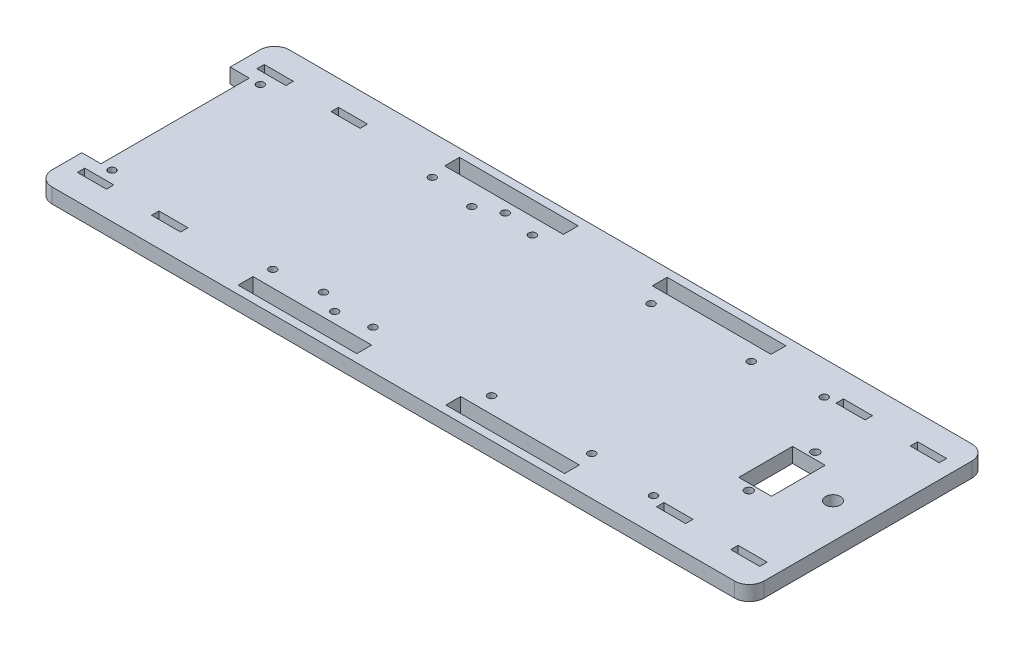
ISO-10303-21;
HEADER;
FILE_DESCRIPTION(('STEP AP214'),'2;1');
FILE_NAME('part.step','',(''),(''),'','','');
FILE_SCHEMA(('AUTOMOTIVE_DESIGN { 1 0 10303 214 1 1 1 1 }'));
ENDSEC;
DATA;
#1=APPLICATION_CONTEXT('core data for automotive mechanical design processes');
#2=APPLICATION_PROTOCOL_DEFINITION('international standard','automotive_design',2000,#1);
#3=PRODUCT_CONTEXT('',#1,'mechanical');
#4=PRODUCT('Part','Part','',(#3));
#5=PRODUCT_RELATED_PRODUCT_CATEGORY('part','',(#4));
#6=PRODUCT_DEFINITION_FORMATION('','',#4);
#7=PRODUCT_DEFINITION_CONTEXT('part definition',#1,'design');
#8=PRODUCT_DEFINITION('design','',#6,#7);
#9=PRODUCT_DEFINITION_SHAPE('','',#8);
#10=(LENGTH_UNIT() NAMED_UNIT(*) SI_UNIT(.MILLI.,.METRE.));
#11=(NAMED_UNIT(*) PLANE_ANGLE_UNIT() SI_UNIT($,.RADIAN.));
#12=(NAMED_UNIT(*) SI_UNIT($,.STERADIAN.) SOLID_ANGLE_UNIT());
#13=UNCERTAINTY_MEASURE_WITH_UNIT(LENGTH_MEASURE(1.E-05),#10,'distance_accuracy_value','');
#14=(GEOMETRIC_REPRESENTATION_CONTEXT(3) GLOBAL_UNCERTAINTY_ASSIGNED_CONTEXT((#13)) GLOBAL_UNIT_ASSIGNED_CONTEXT((#10,
#11,#12)) REPRESENTATION_CONTEXT('',''));
#15=CARTESIAN_POINT('',(0.,0.,0.));
#16=DIRECTION('',(0.,0.,1.));
#17=DIRECTION('',(1.,0.,0.));
#18=AXIS2_PLACEMENT_3D('',#15,#16,#17);
#19=CARTESIAN_POINT('',(146.05,6.35,-6.35000000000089));
#20=DIRECTION('',(0.,1.,0.));
#21=DIRECTION('',(0.,0.,1.));
#22=AXIS2_PLACEMENT_3D('',#19,#20,#21);
#23=PLANE('',#22);
#24=DIRECTION('',(1.,0.,0.));
#25=VECTOR('',#24,1.);
#26=CARTESIAN_POINT('',(101.854000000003,6.35,-10.7949999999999));
#27=LINE('',#26,#25);
#28=CARTESIAN_POINT('',(101.854000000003,6.35,-10.7949999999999));
#29=VERTEX_POINT('',#28);
#30=CARTESIAN_POINT('',(114.300000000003,6.35,-10.7949999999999));
#31=VERTEX_POINT('',#30);
#32=EDGE_CURVE('E470',#29,#31,#27,.T.);
#33=ORIENTED_EDGE('',*,*,#32,.F.);
#34=DIRECTION('',(0.,0.,1.));
#35=VECTOR('',#34,1.);
#36=CARTESIAN_POINT('',(101.854000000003,6.35,-13.97));
#37=LINE('',#36,#35);
#38=CARTESIAN_POINT('',(101.854000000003,6.35,-13.97));
#39=VERTEX_POINT('',#38);
#40=EDGE_CURVE('E468',#39,#29,#37,.T.);
#41=ORIENTED_EDGE('',*,*,#40,.F.);
#42=DIRECTION('',(-1.,0.,0.));
#43=VECTOR('',#42,1.);
#44=CARTESIAN_POINT('',(101.854000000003,6.35,-13.97));
#45=LINE('',#44,#43);
#46=CARTESIAN_POINT('',(114.300000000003,6.35,-13.97));
#47=VERTEX_POINT('',#46);
#48=EDGE_CURVE('E476',#47,#39,#45,.T.);
#49=ORIENTED_EDGE('',*,*,#48,.F.);
#50=DIRECTION('',(0.,0.,-1.));
#51=VECTOR('',#50,1.);
#52=CARTESIAN_POINT('',(114.300000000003,6.35,-13.97));
#53=LINE('',#52,#51);
#54=EDGE_CURVE('E473',#31,#47,#53,.T.);
#55=ORIENTED_EDGE('',*,*,#54,.F.);
#56=EDGE_LOOP('',(#33,#41,#49,#55));
#57=FACE_BOUND('',#56,.T.);
#58=DIRECTION('',(1.,0.,0.));
#59=VECTOR('',#58,1.);
#60=CARTESIAN_POINT('',(-146.050000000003,6.35,-10.795));
#61=LINE('',#60,#59);
#62=CARTESIAN_POINT('',(-146.050000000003,6.35,-10.795));
#63=VERTEX_POINT('',#62);
#64=CARTESIAN_POINT('',(-133.604000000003,6.35,-10.795));
#65=VERTEX_POINT('',#64);
#66=EDGE_CURVE('E532',#63,#65,#61,.T.);
#67=ORIENTED_EDGE('',*,*,#66,.F.);
#68=DIRECTION('',(0.,0.,1.));
#69=VECTOR('',#68,1.);
#70=CARTESIAN_POINT('',(-146.050000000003,6.35,-13.97));
#71=LINE('',#70,#69);
#72=CARTESIAN_POINT('',(-146.050000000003,6.35,-13.97));
#73=VERTEX_POINT('',#72);
#74=EDGE_CURVE('E530',#73,#63,#71,.T.);
#75=ORIENTED_EDGE('',*,*,#74,.F.);
#76=DIRECTION('',(-1.,0.,0.));
#77=VECTOR('',#76,1.);
#78=CARTESIAN_POINT('',(-146.050000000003,6.35,-13.97));
#79=LINE('',#78,#77);
#80=CARTESIAN_POINT('',(-133.604000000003,6.35,-13.97));
#81=VERTEX_POINT('',#80);
#82=EDGE_CURVE('E538',#81,#73,#79,.T.);
#83=ORIENTED_EDGE('',*,*,#82,.F.);
#84=DIRECTION('',(0.,0.,-1.));
#85=VECTOR('',#84,1.);
#86=CARTESIAN_POINT('',(-133.604000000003,6.35,-13.97));
#87=LINE('',#86,#85);
#88=EDGE_CURVE('E535',#65,#81,#87,.T.);
#89=ORIENTED_EDGE('',*,*,#88,.F.);
#90=EDGE_LOOP('',(#67,#75,#83,#89));
#91=FACE_BOUND('',#90,.T.);
#92=DIRECTION('',(0.,0.,-1.));
#93=VECTOR('',#92,1.);
#94=CARTESIAN_POINT('',(114.300000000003,6.35,-87.63));
#95=LINE('',#94,#93);
#96=CARTESIAN_POINT('',(114.300000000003,6.35,-87.63));
#97=VERTEX_POINT('',#96);
#98=CARTESIAN_POINT('',(114.300000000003,6.35,-90.8050000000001));
#99=VERTEX_POINT('',#98);
#100=EDGE_CURVE('E594',#97,#99,#95,.T.);
#101=ORIENTED_EDGE('',*,*,#100,.F.);
#102=DIRECTION('',(1.,0.,0.));
#103=VECTOR('',#102,1.);
#104=CARTESIAN_POINT('',(101.854000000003,6.35,-87.63));
#105=LINE('',#104,#103);
#106=CARTESIAN_POINT('',(101.854000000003,6.35,-87.63));
#107=VERTEX_POINT('',#106);
#108=EDGE_CURVE('E592',#107,#97,#105,.T.);
#109=ORIENTED_EDGE('',*,*,#108,.F.);
#110=DIRECTION('',(0.,0.,1.));
#111=VECTOR('',#110,1.);
#112=CARTESIAN_POINT('',(101.854000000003,6.35,-87.63));
#113=LINE('',#112,#111);
#114=CARTESIAN_POINT('',(101.854000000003,6.35,-90.8050000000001));
#115=VERTEX_POINT('',#114);
#116=EDGE_CURVE('E600',#115,#107,#113,.T.);
#117=ORIENTED_EDGE('',*,*,#116,.F.);
#118=DIRECTION('',(-1.,0.,0.));
#119=VECTOR('',#118,1.);
#120=CARTESIAN_POINT('',(101.854000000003,6.35,-90.8050000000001));
#121=LINE('',#120,#119);
#122=EDGE_CURVE('E597',#99,#115,#121,.T.);
#123=ORIENTED_EDGE('',*,*,#122,.F.);
#124=EDGE_LOOP('',(#101,#109,#117,#123));
#125=FACE_BOUND('',#124,.T.);
#126=CARTESIAN_POINT('',(115.56727119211,6.35,-36.55));
#127=DIRECTION('',(0.,1.,0.));
#128=DIRECTION('',(0.,0.,-1.));
#129=AXIS2_PLACEMENT_3D('',#126,#127,#128);
#130=CIRCLE('',#129,1.75);
#131=CARTESIAN_POINT('',(115.56727119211,6.35,-38.3));
#132=VERTEX_POINT('',#131);
#133=EDGE_CURVE('E654',#132,#132,#130,.T.);
#134=ORIENTED_EDGE('',*,*,#133,.F.);
#135=EDGE_LOOP('',(#134));
#136=FACE_BOUND('',#135,.T.);
#137=DIRECTION('',(-1.,0.,0.));
#138=VECTOR('',#137,1.);
#139=CARTESIAN_POINT('',(69.8499999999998,6.35,-9.77900000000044));
#140=LINE('',#139,#138);
#141=CARTESIAN_POINT('',(69.8499999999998,6.35,-9.77900000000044));
#142=VERTEX_POINT('',#141);
#143=CARTESIAN_POINT('',(19.0499999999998,6.35,-9.779));
#144=VERTEX_POINT('',#143);
#145=EDGE_CURVE('E668',#142,#144,#140,.T.);
#146=ORIENTED_EDGE('',*,*,#145,.F.);
#147=DIRECTION('',(0.,0.,-1.));
#148=VECTOR('',#147,1.);
#149=CARTESIAN_POINT('',(69.8499999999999,6.35,-3.42900000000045));
#150=LINE('',#149,#148);
#151=CARTESIAN_POINT('',(69.8499999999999,6.35,-3.42900000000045));
#152=VERTEX_POINT('',#151);
#153=EDGE_CURVE('E666',#152,#142,#150,.T.);
#154=ORIENTED_EDGE('',*,*,#153,.F.);
#155=DIRECTION('',(1.,0.,0.));
#156=VECTOR('',#155,1.);
#157=CARTESIAN_POINT('',(69.8499999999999,6.35,-3.42900000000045));
#158=LINE('',#157,#156);
#159=CARTESIAN_POINT('',(19.0499999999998,6.35,-3.429));
#160=VERTEX_POINT('',#159);
#161=EDGE_CURVE('E674',#160,#152,#158,.T.);
#162=ORIENTED_EDGE('',*,*,#161,.F.);
#163=DIRECTION('',(0.,0.,1.));
#164=VECTOR('',#163,1.);
#165=CARTESIAN_POINT('',(19.0499999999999,6.35,-3.429));
#166=LINE('',#165,#164);
#167=EDGE_CURVE('E671',#144,#160,#166,.T.);
#168=ORIENTED_EDGE('',*,*,#167,.F.);
#169=EDGE_LOOP('',(#146,#154,#162,#168));
#170=FACE_BOUND('',#169,.T.);
#171=DIRECTION('',(0.,0.,-1.));
#172=VECTOR('',#171,1.);
#173=CARTESIAN_POINT('',(-19.05,6.35,-3.429));
#174=LINE('',#173,#172);
#175=CARTESIAN_POINT('',(-19.05,6.35,-3.429));
#176=VERTEX_POINT('',#175);
#177=CARTESIAN_POINT('',(-19.05,6.35,-9.779));
#178=VERTEX_POINT('',#177);
#179=EDGE_CURVE('E730',#176,#178,#174,.T.);
#180=ORIENTED_EDGE('',*,*,#179,.F.);
#181=DIRECTION('',(1.,0.,0.));
#182=VECTOR('',#181,1.);
#183=CARTESIAN_POINT('',(-69.85,6.35,-3.429));
#184=LINE('',#183,#182);
#185=CARTESIAN_POINT('',(-69.85,6.35,-3.429));
#186=VERTEX_POINT('',#185);
#187=EDGE_CURVE('E728',#186,#176,#184,.T.);
#188=ORIENTED_EDGE('',*,*,#187,.F.);
#189=DIRECTION('',(0.,0.,1.));
#190=VECTOR('',#189,1.);
#191=CARTESIAN_POINT('',(-69.85,6.35,-3.429));
#192=LINE('',#191,#190);
#193=CARTESIAN_POINT('',(-69.85,6.35,-9.779));
#194=VERTEX_POINT('',#193);
#195=EDGE_CURVE('E736',#194,#186,#192,.T.);
#196=ORIENTED_EDGE('',*,*,#195,.F.);
#197=DIRECTION('',(-1.,0.,0.));
#198=VECTOR('',#197,1.);
#199=CARTESIAN_POINT('',(-69.85,6.35,-9.779));
#200=LINE('',#199,#198);
#201=EDGE_CURVE('E733',#178,#194,#200,.T.);
#202=ORIENTED_EDGE('',*,*,#201,.F.);
#203=EDGE_LOOP('',(#180,#188,#196,#202));
#204=FACE_BOUND('',#203,.T.);
#205=DIRECTION('',(1.,0.,0.));
#206=VECTOR('',#205,1.);
#207=CARTESIAN_POINT('',(-69.85,6.35,-91.821));
#208=LINE('',#207,#206);
#209=CARTESIAN_POINT('',(-69.85,6.35,-91.821));
#210=VERTEX_POINT('',#209);
#211=CARTESIAN_POINT('',(-19.05,6.35,-91.821));
#212=VERTEX_POINT('',#211);
#213=EDGE_CURVE('E792',#210,#212,#208,.T.);
#214=ORIENTED_EDGE('',*,*,#213,.F.);
#215=DIRECTION('',(0.,0.,1.));
#216=VECTOR('',#215,1.);
#217=CARTESIAN_POINT('',(-69.85,6.35,-98.171));
#218=LINE('',#217,#216);
#219=CARTESIAN_POINT('',(-69.85,6.35,-98.171));
#220=VERTEX_POINT('',#219);
#221=EDGE_CURVE('E790',#220,#210,#218,.T.);
#222=ORIENTED_EDGE('',*,*,#221,.F.);
#223=DIRECTION('',(-1.,0.,0.));
#224=VECTOR('',#223,1.);
#225=CARTESIAN_POINT('',(-69.85,6.35,-98.171));
#226=LINE('',#225,#224);
#227=CARTESIAN_POINT('',(-19.05,6.35,-98.171));
#228=VERTEX_POINT('',#227);
#229=EDGE_CURVE('E798',#228,#220,#226,.T.);
#230=ORIENTED_EDGE('',*,*,#229,.F.);
#231=DIRECTION('',(0.,0.,-1.));
#232=VECTOR('',#231,1.);
#233=CARTESIAN_POINT('',(-19.05,6.35,-98.171));
#234=LINE('',#233,#232);
#235=EDGE_CURVE('E795',#212,#228,#234,.T.);
#236=ORIENTED_EDGE('',*,*,#235,.F.);
#237=EDGE_LOOP('',(#214,#222,#230,#236));
#238=FACE_BOUND('',#237,.T.);
#239=CARTESIAN_POINT('',(137.382106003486,6.35,-50.8));
#240=DIRECTION('',(0.,1.,0.));
#241=DIRECTION('',(0.,0.,1.));
#242=AXIS2_PLACEMENT_3D('',#239,#240,#241);
#243=CIRCLE('',#242,3.175);
#244=CARTESIAN_POINT('',(137.382106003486,6.35,-47.625));
#245=VERTEX_POINT('',#244);
#246=EDGE_CURVE('E852',#245,#245,#243,.T.);
#247=ORIENTED_EDGE('',*,*,#246,.F.);
#248=EDGE_LOOP('',(#247));
#249=FACE_BOUND('',#248,.T.);
#250=CARTESIAN_POINT('',(25.3999999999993,6.35,-84.93125));
#251=DIRECTION('',(0.,1.,0.));
#252=DIRECTION('',(0.,0.,-1.));
#253=AXIS2_PLACEMENT_3D('',#250,#251,#252);
#254=CIRCLE('',#253,1.58749999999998);
#255=CARTESIAN_POINT('',(25.3999999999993,6.35,-86.51875));
#256=VERTEX_POINT('',#255);
#257=EDGE_CURVE('E864',#256,#256,#254,.T.);
#258=ORIENTED_EDGE('',*,*,#257,.F.);
#259=EDGE_LOOP('',(#258));
#260=FACE_BOUND('',#259,.T.);
#261=CARTESIAN_POINT('',(68.2624999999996,6.35,-16.6687500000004));
#262=DIRECTION('',(0.,1.,0.));
#263=DIRECTION('',(0.,0.,-1.));
#264=AXIS2_PLACEMENT_3D('',#261,#262,#263);
#265=CIRCLE('',#264,1.58750000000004);
#266=CARTESIAN_POINT('',(68.2624999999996,6.35,-18.2562500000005));
#267=VERTEX_POINT('',#266);
#268=EDGE_CURVE('E876',#267,#267,#265,.T.);
#269=ORIENTED_EDGE('',*,*,#268,.F.);
#270=EDGE_LOOP('',(#269));
#271=FACE_BOUND('',#270,.T.);
#272=CARTESIAN_POINT('',(-25.4,6.35,-84.93125));
#273=DIRECTION('',(0.,1.,0.));
#274=DIRECTION('',(0.,0.,1.));
#275=AXIS2_PLACEMENT_3D('',#272,#273,#274);
#276=CIRCLE('',#275,1.58749999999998);
#277=CARTESIAN_POINT('',(-25.4,6.35,-83.3437500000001));
#278=VERTEX_POINT('',#277);
#279=EDGE_CURVE('E888',#278,#278,#276,.T.);
#280=ORIENTED_EDGE('',*,*,#279,.F.);
#281=EDGE_LOOP('',(#280));
#282=FACE_BOUND('',#281,.T.);
#283=CARTESIAN_POINT('',(-68.2625,6.35,-84.93125));
#284=DIRECTION('',(0.,1.,0.));
#285=DIRECTION('',(0.,0.,1.));
#286=AXIS2_PLACEMENT_3D('',#283,#284,#285);
#287=CIRCLE('',#286,1.58750000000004);
#288=CARTESIAN_POINT('',(-68.2625,6.35,-83.3437499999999));
#289=VERTEX_POINT('',#288);
#290=EDGE_CURVE('E900',#289,#289,#287,.T.);
#291=ORIENTED_EDGE('',*,*,#290,.F.);
#292=EDGE_LOOP('',(#291));
#293=FACE_BOUND('',#292,.T.);
#294=CARTESIAN_POINT('',(-139.445999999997,6.35,-82.55));
#295=DIRECTION('',(0.,1.,0.));
#296=DIRECTION('',(0.,0.,1.));
#297=AXIS2_PLACEMENT_3D('',#294,#295,#296);
#298=CIRCLE('',#297,1.58749999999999);
#299=CARTESIAN_POINT('',(-139.445999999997,6.35,-80.9625));
#300=VERTEX_POINT('',#299);
#301=EDGE_CURVE('E912',#300,#300,#298,.T.);
#302=ORIENTED_EDGE('',*,*,#301,.F.);
#303=EDGE_LOOP('',(#302));
#304=FACE_BOUND('',#303,.T.);
#305=CARTESIAN_POINT('',(-139.445999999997,6.35,-19.05));
#306=DIRECTION('',(0.,1.,0.));
#307=DIRECTION('',(0.,0.,1.));
#308=AXIS2_PLACEMENT_3D('',#305,#306,#307);
#309=CIRCLE('',#308,1.58749999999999);
#310=CARTESIAN_POINT('',(-139.445999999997,6.35,-17.4625));
#311=VERTEX_POINT('',#310);
#312=EDGE_CURVE('E924',#311,#311,#309,.T.);
#313=ORIENTED_EDGE('',*,*,#312,.F.);
#314=EDGE_LOOP('',(#313));
#315=FACE_BOUND('',#314,.T.);
#316=CARTESIAN_POINT('',(-39.4334999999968,6.35,-87.3125));
#317=DIRECTION('',(0.,1.,0.));
#318=DIRECTION('',(0.,0.,1.));
#319=AXIS2_PLACEMENT_3D('',#316,#317,#318);
#320=CIRCLE('',#319,1.58749999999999);
#321=CARTESIAN_POINT('',(-39.4334999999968,6.35,-85.725));
#322=VERTEX_POINT('',#321);
#323=EDGE_CURVE('E936',#322,#322,#320,.T.);
#324=ORIENTED_EDGE('',*,*,#323,.F.);
#325=EDGE_LOOP('',(#324));
#326=FACE_BOUND('',#325,.T.);
#327=CARTESIAN_POINT('',(-39.4334999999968,6.35,-14.2875));
#328=DIRECTION('',(0.,1.,0.));
#329=DIRECTION('',(0.,0.,1.));
#330=AXIS2_PLACEMENT_3D('',#327,#328,#329);
#331=CIRCLE('',#330,1.58749999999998);
#332=CARTESIAN_POINT('',(-39.4334999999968,6.35,-12.7));
#333=VERTEX_POINT('',#332);
#334=EDGE_CURVE('E948',#333,#333,#331,.T.);
#335=ORIENTED_EDGE('',*,*,#334,.F.);
#336=EDGE_LOOP('',(#335));
#337=FACE_BOUND('',#336,.T.);
#338=CARTESIAN_POINT('',(146.05,6.35,-6.35000000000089));
#339=DIRECTION('',(0.,1.,0.));
#340=DIRECTION('',(0.,0.,1.));
#341=AXIS2_PLACEMENT_3D('',#338,#339,#340);
#342=CIRCLE('',#341,6.35000000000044);
#343=CARTESIAN_POINT('',(146.05,6.35,0.));
#344=VERTEX_POINT('',#343);
#345=CARTESIAN_POINT('',(152.4,6.35,-6.35000000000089));
#346=VERTEX_POINT('',#345);
#347=EDGE_CURVE('E954',#344,#346,#342,.T.);
#348=ORIENTED_EDGE('',*,*,#347,.T.);
#349=DIRECTION('',(0.,0.,-1.));
#350=VECTOR('',#349,1.);
#351=CARTESIAN_POINT('',(152.4,6.35,-6.35000000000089));
#352=LINE('',#351,#350);
#353=CARTESIAN_POINT('',(152.4,6.35,-95.2499999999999));
#354=VERTEX_POINT('',#353);
#355=EDGE_CURVE('E957',#346,#354,#352,.T.);
#356=ORIENTED_EDGE('',*,*,#355,.T.);
#357=CARTESIAN_POINT('',(146.05,6.35,-95.25));
#358=DIRECTION('',(0.,1.,0.));
#359=DIRECTION('',(0.,0.,-1.));
#360=AXIS2_PLACEMENT_3D('',#357,#358,#359);
#361=CIRCLE('',#360,6.35000000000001);
#362=CARTESIAN_POINT('',(146.05,6.35,-101.6));
#363=VERTEX_POINT('',#362);
#364=EDGE_CURVE('E960',#354,#363,#361,.T.);
#365=ORIENTED_EDGE('',*,*,#364,.T.);
#366=DIRECTION('',(-1.,0.,0.));
#367=VECTOR('',#366,1.);
#368=CARTESIAN_POINT('',(-146.05,6.35,-101.6));
#369=LINE('',#368,#367);
#370=CARTESIAN_POINT('',(-146.05,6.35,-101.6));
#371=VERTEX_POINT('',#370);
#372=EDGE_CURVE('E962',#363,#371,#369,.T.);
#373=ORIENTED_EDGE('',*,*,#372,.T.);
#374=CARTESIAN_POINT('',(-146.05,6.35,-95.25));
#375=DIRECTION('',(0.,1.,0.));
#376=DIRECTION('',(0.,0.,-1.));
#377=AXIS2_PLACEMENT_3D('',#374,#375,#376);
#378=CIRCLE('',#377,6.34999999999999);
#379=CARTESIAN_POINT('',(-152.4,6.35,-95.2499999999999));
#380=VERTEX_POINT('',#379);
#381=EDGE_CURVE('E964',#371,#380,#378,.T.);
#382=ORIENTED_EDGE('',*,*,#381,.T.);
#383=DIRECTION('',(0.,0.,1.));
#384=VECTOR('',#383,1.);
#385=CARTESIAN_POINT('',(-152.4,6.35,-82.55));
#386=LINE('',#385,#384);
#387=CARTESIAN_POINT('',(-152.4,6.35,-82.55));
#388=VERTEX_POINT('',#387);
#389=EDGE_CURVE('E966',#380,#388,#386,.T.);
#390=ORIENTED_EDGE('',*,*,#389,.T.);
#391=DIRECTION('',(1.,0.,0.));
#392=VECTOR('',#391,1.);
#393=CARTESIAN_POINT('',(-152.4,6.35,-82.55));
#394=LINE('',#393,#392);
#395=CARTESIAN_POINT('',(-144.208499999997,6.35,-82.55));
#396=VERTEX_POINT('',#395);
#397=EDGE_CURVE('E968',#388,#396,#394,.T.);
#398=ORIENTED_EDGE('',*,*,#397,.T.);
#399=DIRECTION('',(0.,0.,1.));
#400=VECTOR('',#399,1.);
#401=CARTESIAN_POINT('',(-144.208499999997,6.35,-82.55));
#402=LINE('',#401,#400);
#403=CARTESIAN_POINT('',(-144.208499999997,6.35,-19.05));
#404=VERTEX_POINT('',#403);
#405=EDGE_CURVE('E970',#396,#404,#402,.T.);
#406=ORIENTED_EDGE('',*,*,#405,.T.);
#407=DIRECTION('',(-1.,0.,0.));
#408=VECTOR('',#407,1.);
#409=CARTESIAN_POINT('',(-152.4,6.35,-19.05));
#410=LINE('',#409,#408);
#411=CARTESIAN_POINT('',(-152.4,6.35,-19.05));
#412=VERTEX_POINT('',#411);
#413=EDGE_CURVE('E972',#404,#412,#410,.T.);
#414=ORIENTED_EDGE('',*,*,#413,.T.);
#415=DIRECTION('',(0.,0.,1.));
#416=VECTOR('',#415,1.);
#417=CARTESIAN_POINT('',(-152.4,6.35,-6.35));
#418=LINE('',#417,#416);
#419=CARTESIAN_POINT('',(-152.4,6.35,-6.35));
#420=VERTEX_POINT('',#419);
#421=EDGE_CURVE('E974',#412,#420,#418,.T.);
#422=ORIENTED_EDGE('',*,*,#421,.T.);
#423=CARTESIAN_POINT('',(-146.05,6.35,-6.35));
#424=DIRECTION('',(0.,1.,0.));
#425=DIRECTION('',(0.,0.,-1.));
#426=AXIS2_PLACEMENT_3D('',#423,#424,#425);
#427=CIRCLE('',#426,6.35);
#428=CARTESIAN_POINT('',(-146.05,6.35,0.));
#429=VERTEX_POINT('',#428);
#430=EDGE_CURVE('E976',#420,#429,#427,.T.);
#431=ORIENTED_EDGE('',*,*,#430,.T.);
#432=DIRECTION('',(1.,0.,0.));
#433=VECTOR('',#432,1.);
#434=CARTESIAN_POINT('',(-146.05,6.35,0.));
#435=LINE('',#434,#433);
#436=EDGE_CURVE('E978',#429,#344,#435,.T.);
#437=ORIENTED_EDGE('',*,*,#436,.T.);
#438=EDGE_LOOP('',(#348,#356,#365,#373,#382,#390,#398,#406,#414,#422,#431,#437));
#439=FACE_BOUND('',#438,.T.);
#440=CARTESIAN_POINT('',(97.0915000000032,6.35,-14.2875));
#441=DIRECTION('',(0.,1.,0.));
#442=DIRECTION('',(0.,0.,1.));
#443=AXIS2_PLACEMENT_3D('',#440,#441,#442);
#444=CIRCLE('',#443,1.58749999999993);
#445=CARTESIAN_POINT('',(97.0915000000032,6.35,-12.7000000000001));
#446=VERTEX_POINT('',#445);
#447=EDGE_CURVE('E942',#446,#446,#444,.T.);
#448=ORIENTED_EDGE('',*,*,#447,.F.);
#449=EDGE_LOOP('',(#448));
#450=FACE_BOUND('',#449,.T.);
#451=CARTESIAN_POINT('',(97.0915000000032,6.35,-87.3125));
#452=DIRECTION('',(0.,1.,0.));
#453=DIRECTION('',(0.,0.,1.));
#454=AXIS2_PLACEMENT_3D('',#451,#452,#453);
#455=CIRCLE('',#454,1.58749999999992);
#456=CARTESIAN_POINT('',(97.0915000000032,6.35,-85.7250000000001));
#457=VERTEX_POINT('',#456);
#458=EDGE_CURVE('E930',#457,#457,#455,.T.);
#459=ORIENTED_EDGE('',*,*,#458,.F.);
#460=EDGE_LOOP('',(#459));
#461=FACE_BOUND('',#460,.T.);
#462=CARTESIAN_POINT('',(-48.9584999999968,6.35,-19.05));
#463=DIRECTION('',(0.,1.,0.));
#464=DIRECTION('',(0.,0.,1.));
#465=AXIS2_PLACEMENT_3D('',#462,#463,#464);
#466=CIRCLE('',#465,1.58749999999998);
#467=CARTESIAN_POINT('',(-48.9584999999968,6.35,-17.4625));
#468=VERTEX_POINT('',#467);
#469=EDGE_CURVE('E918',#468,#468,#466,.T.);
#470=ORIENTED_EDGE('',*,*,#469,.F.);
#471=EDGE_LOOP('',(#470));
#472=FACE_BOUND('',#471,.T.);
#473=CARTESIAN_POINT('',(-48.9584999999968,6.35,-82.55));
#474=DIRECTION('',(0.,1.,0.));
#475=DIRECTION('',(0.,0.,1.));
#476=AXIS2_PLACEMENT_3D('',#473,#474,#475);
#477=CIRCLE('',#476,1.58749999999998);
#478=CARTESIAN_POINT('',(-48.9584999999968,6.35,-80.9625));
#479=VERTEX_POINT('',#478);
#480=EDGE_CURVE('E906',#479,#479,#477,.T.);
#481=ORIENTED_EDGE('',*,*,#480,.F.);
#482=EDGE_LOOP('',(#481));
#483=FACE_BOUND('',#482,.T.);
#484=CARTESIAN_POINT('',(-68.2624999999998,6.35,-16.66875));
#485=DIRECTION('',(0.,1.,0.));
#486=DIRECTION('',(0.,0.,1.));
#487=AXIS2_PLACEMENT_3D('',#484,#485,#486);
#488=CIRCLE('',#487,1.58750000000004);
#489=CARTESIAN_POINT('',(-68.2624999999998,6.35,-15.0812499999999));
#490=VERTEX_POINT('',#489);
#491=EDGE_CURVE('E894',#490,#490,#488,.T.);
#492=ORIENTED_EDGE('',*,*,#491,.F.);
#493=EDGE_LOOP('',(#492));
#494=FACE_BOUND('',#493,.T.);
#495=CARTESIAN_POINT('',(-25.4,6.35,-16.66875));
#496=DIRECTION('',(0.,1.,0.));
#497=DIRECTION('',(0.,0.,1.));
#498=AXIS2_PLACEMENT_3D('',#495,#496,#497);
#499=CIRCLE('',#498,1.58750000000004);
#500=CARTESIAN_POINT('',(-25.4,6.35,-15.0812499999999));
#501=VERTEX_POINT('',#500);
#502=EDGE_CURVE('E882',#501,#501,#499,.T.);
#503=ORIENTED_EDGE('',*,*,#502,.F.);
#504=EDGE_LOOP('',(#503));
#505=FACE_BOUND('',#504,.T.);
#506=CARTESIAN_POINT('',(25.3999999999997,6.35,-16.66875));
#507=DIRECTION('',(0.,1.,0.));
#508=DIRECTION('',(0.,0.,-1.));
#509=AXIS2_PLACEMENT_3D('',#506,#507,#508);
#510=CIRCLE('',#509,1.58750000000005);
#511=CARTESIAN_POINT('',(25.3999999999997,6.35,-18.25625));
#512=VERTEX_POINT('',#511);
#513=EDGE_CURVE('E870',#512,#512,#510,.T.);
#514=ORIENTED_EDGE('',*,*,#513,.F.);
#515=EDGE_LOOP('',(#514));
#516=FACE_BOUND('',#515,.T.);
#517=CARTESIAN_POINT('',(68.2624999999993,6.35,-84.9312500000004));
#518=DIRECTION('',(0.,1.,0.));
#519=DIRECTION('',(0.,0.,-1.));
#520=AXIS2_PLACEMENT_3D('',#517,#518,#519);
#521=CIRCLE('',#520,1.58750000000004);
#522=CARTESIAN_POINT('',(68.2624999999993,6.35,-86.5187500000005));
#523=VERTEX_POINT('',#522);
#524=EDGE_CURVE('E858',#523,#523,#521,.T.);
#525=ORIENTED_EDGE('',*,*,#524,.F.);
#526=EDGE_LOOP('',(#525));
#527=FACE_BOUND('',#526,.T.);
#528=DIRECTION('',(1.,0.,0.));
#529=VECTOR('',#528,1.);
#530=CARTESIAN_POINT('',(108.56727119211,6.35,-39.3));
#531=LINE('',#530,#529);
#532=CARTESIAN_POINT('',(108.56727119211,6.35,-39.3));
#533=VERTEX_POINT('',#532);
#534=CARTESIAN_POINT('',(122.56727119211,6.35,-39.3));
#535=VERTEX_POINT('',#534);
#536=EDGE_CURVE('E823',#533,#535,#531,.T.);
#537=ORIENTED_EDGE('',*,*,#536,.F.);
#538=DIRECTION('',(0.,0.,1.));
#539=VECTOR('',#538,1.);
#540=CARTESIAN_POINT('',(108.56727119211,6.35,-62.3));
#541=LINE('',#540,#539);
#542=CARTESIAN_POINT('',(108.56727119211,6.35,-62.3));
#543=VERTEX_POINT('',#542);
#544=EDGE_CURVE('E821',#543,#533,#541,.T.);
#545=ORIENTED_EDGE('',*,*,#544,.F.);
#546=DIRECTION('',(-1.,0.,0.));
#547=VECTOR('',#546,1.);
#548=CARTESIAN_POINT('',(108.56727119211,6.35,-62.3));
#549=LINE('',#548,#547);
#550=CARTESIAN_POINT('',(122.56727119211,6.35,-62.3));
#551=VERTEX_POINT('',#550);
#552=EDGE_CURVE('E829',#551,#543,#549,.T.);
#553=ORIENTED_EDGE('',*,*,#552,.F.);
#554=DIRECTION('',(0.,0.,-1.));
#555=VECTOR('',#554,1.);
#556=CARTESIAN_POINT('',(122.56727119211,6.35,-62.3));
#557=LINE('',#556,#555);
#558=EDGE_CURVE('E826',#535,#551,#557,.T.);
#559=ORIENTED_EDGE('',*,*,#558,.F.);
#560=EDGE_LOOP('',(#537,#545,#553,#559));
#561=FACE_BOUND('',#560,.T.);
#562=DIRECTION('',(0.,0.,-1.));
#563=VECTOR('',#562,1.);
#564=CARTESIAN_POINT('',(-133.604000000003,6.35,-87.63));
#565=LINE('',#564,#563);
#566=CARTESIAN_POINT('',(-133.604000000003,6.35,-87.63));
#567=VERTEX_POINT('',#566);
#568=CARTESIAN_POINT('',(-133.604000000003,6.35,-90.805));
#569=VERTEX_POINT('',#568);
#570=EDGE_CURVE('E761',#567,#569,#565,.T.);
#571=ORIENTED_EDGE('',*,*,#570,.F.);
#572=DIRECTION('',(1.,0.,0.));
#573=VECTOR('',#572,1.);
#574=CARTESIAN_POINT('',(-146.050000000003,6.35,-87.63));
#575=LINE('',#574,#573);
#576=CARTESIAN_POINT('',(-146.050000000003,6.35,-87.63));
#577=VERTEX_POINT('',#576);
#578=EDGE_CURVE('E759',#577,#567,#575,.T.);
#579=ORIENTED_EDGE('',*,*,#578,.F.);
#580=DIRECTION('',(0.,0.,1.));
#581=VECTOR('',#580,1.);
#582=CARTESIAN_POINT('',(-146.050000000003,6.35,-87.63));
#583=LINE('',#582,#581);
#584=CARTESIAN_POINT('',(-146.050000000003,6.35,-90.805));
#585=VERTEX_POINT('',#584);
#586=EDGE_CURVE('E767',#585,#577,#583,.T.);
#587=ORIENTED_EDGE('',*,*,#586,.F.);
#588=DIRECTION('',(-1.,0.,0.));
#589=VECTOR('',#588,1.);
#590=CARTESIAN_POINT('',(-146.050000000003,6.35,-90.805));
#591=LINE('',#590,#589);
#592=EDGE_CURVE('E764',#569,#585,#591,.T.);
#593=ORIENTED_EDGE('',*,*,#592,.F.);
#594=EDGE_LOOP('',(#571,#579,#587,#593));
#595=FACE_BOUND('',#594,.T.);
#596=DIRECTION('',(0.,0.,1.));
#597=VECTOR('',#596,1.);
#598=CARTESIAN_POINT('',(19.0499999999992,6.35,-98.171));
#599=LINE('',#598,#597);
#600=CARTESIAN_POINT('',(19.0499999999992,6.35,-98.171));
#601=VERTEX_POINT('',#600);
#602=CARTESIAN_POINT('',(19.0499999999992,6.35,-91.821));
#603=VERTEX_POINT('',#602);
#604=EDGE_CURVE('E699',#601,#603,#599,.T.);
#605=ORIENTED_EDGE('',*,*,#604,.F.);
#606=DIRECTION('',(-1.,0.,0.));
#607=VECTOR('',#606,1.);
#608=CARTESIAN_POINT('',(69.8499999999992,6.35,-98.1710000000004));
#609=LINE('',#608,#607);
#610=CARTESIAN_POINT('',(69.8499999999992,6.35,-98.1710000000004));
#611=VERTEX_POINT('',#610);
#612=EDGE_CURVE('E697',#611,#601,#609,.T.);
#613=ORIENTED_EDGE('',*,*,#612,.F.);
#614=DIRECTION('',(0.,0.,-1.));
#615=VECTOR('',#614,1.);
#616=CARTESIAN_POINT('',(69.8499999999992,6.35,-98.1710000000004));
#617=LINE('',#616,#615);
#618=CARTESIAN_POINT('',(69.8499999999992,6.35,-91.8210000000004));
#619=VERTEX_POINT('',#618);
#620=EDGE_CURVE('E705',#619,#611,#617,.T.);
#621=ORIENTED_EDGE('',*,*,#620,.F.);
#622=DIRECTION('',(1.,0.,0.));
#623=VECTOR('',#622,1.);
#624=CARTESIAN_POINT('',(69.8499999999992,6.35,-91.8210000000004));
#625=LINE('',#624,#623);
#626=EDGE_CURVE('E702',#603,#619,#625,.T.);
#627=ORIENTED_EDGE('',*,*,#626,.F.);
#628=EDGE_LOOP('',(#605,#613,#621,#627));
#629=FACE_BOUND('',#628,.T.);
#630=CARTESIAN_POINT('',(115.56727119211,6.35,-65.05));
#631=DIRECTION('',(0.,1.,0.));
#632=DIRECTION('',(0.,0.,1.));
#633=AXIS2_PLACEMENT_3D('',#630,#631,#632);
#634=CIRCLE('',#633,1.75);
#635=CARTESIAN_POINT('',(115.56727119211,6.35,-63.3));
#636=VERTEX_POINT('',#635);
#637=EDGE_CURVE('E660',#636,#636,#634,.T.);
#638=ORIENTED_EDGE('',*,*,#637,.F.);
#639=EDGE_LOOP('',(#638));
#640=FACE_BOUND('',#639,.T.);
#641=DIRECTION('',(-1.,0.,0.));
#642=VECTOR('',#641,1.);
#643=CARTESIAN_POINT('',(-101.854000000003,6.35,-90.805));
#644=LINE('',#643,#642);
#645=CARTESIAN_POINT('',(-101.854000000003,6.35,-90.805));
#646=VERTEX_POINT('',#645);
#647=CARTESIAN_POINT('',(-114.300000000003,6.35,-90.805));
#648=VERTEX_POINT('',#647);
#649=EDGE_CURVE('E625',#646,#648,#644,.T.);
#650=ORIENTED_EDGE('',*,*,#649,.F.);
#651=DIRECTION('',(0.,0.,-1.));
#652=VECTOR('',#651,1.);
#653=CARTESIAN_POINT('',(-101.854000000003,6.35,-87.63));
#654=LINE('',#653,#652);
#655=CARTESIAN_POINT('',(-101.854000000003,6.35,-87.63));
#656=VERTEX_POINT('',#655);
#657=EDGE_CURVE('E623',#656,#646,#654,.T.);
#658=ORIENTED_EDGE('',*,*,#657,.F.);
#659=DIRECTION('',(1.,0.,0.));
#660=VECTOR('',#659,1.);
#661=CARTESIAN_POINT('',(-101.854000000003,6.35,-87.63));
#662=LINE('',#661,#660);
#663=CARTESIAN_POINT('',(-114.300000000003,6.35,-87.63));
#664=VERTEX_POINT('',#663);
#665=EDGE_CURVE('E631',#664,#656,#662,.T.);
#666=ORIENTED_EDGE('',*,*,#665,.F.);
#667=DIRECTION('',(0.,0.,1.));
#668=VECTOR('',#667,1.);
#669=CARTESIAN_POINT('',(-114.300000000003,6.35,-87.63));
#670=LINE('',#669,#668);
#671=EDGE_CURVE('E628',#648,#664,#670,.T.);
#672=ORIENTED_EDGE('',*,*,#671,.F.);
#673=EDGE_LOOP('',(#650,#658,#666,#672));
#674=FACE_BOUND('',#673,.T.);
#675=DIRECTION('',(0.,0.,1.));
#676=VECTOR('',#675,1.);
#677=CARTESIAN_POINT('',(-114.300000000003,6.35,-13.97));
#678=LINE('',#677,#676);
#679=CARTESIAN_POINT('',(-114.300000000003,6.35,-13.97));
#680=VERTEX_POINT('',#679);
#681=CARTESIAN_POINT('',(-114.300000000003,6.35,-10.795));
#682=VERTEX_POINT('',#681);
#683=EDGE_CURVE('E563',#680,#682,#678,.T.);
#684=ORIENTED_EDGE('',*,*,#683,.F.);
#685=DIRECTION('',(-1.,0.,0.));
#686=VECTOR('',#685,1.);
#687=CARTESIAN_POINT('',(-101.854000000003,6.35,-13.97));
#688=LINE('',#687,#686);
#689=CARTESIAN_POINT('',(-101.854000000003,6.35,-13.97));
#690=VERTEX_POINT('',#689);
#691=EDGE_CURVE('E561',#690,#680,#688,.T.);
#692=ORIENTED_EDGE('',*,*,#691,.F.);
#693=DIRECTION('',(0.,0.,-1.));
#694=VECTOR('',#693,1.);
#695=CARTESIAN_POINT('',(-101.854000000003,6.35,-13.97));
#696=LINE('',#695,#694);
#697=CARTESIAN_POINT('',(-101.854000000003,6.35,-10.795));
#698=VERTEX_POINT('',#697);
#699=EDGE_CURVE('E569',#698,#690,#696,.T.);
#700=ORIENTED_EDGE('',*,*,#699,.F.);
#701=DIRECTION('',(1.,0.,0.));
#702=VECTOR('',#701,1.);
#703=CARTESIAN_POINT('',(-101.854000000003,6.35,-10.795));
#704=LINE('',#703,#702);
#705=EDGE_CURVE('E566',#682,#698,#704,.T.);
#706=ORIENTED_EDGE('',*,*,#705,.F.);
#707=EDGE_LOOP('',(#684,#692,#700,#706));
#708=FACE_BOUND('',#707,.T.);
#709=DIRECTION('',(-1.,0.,0.));
#710=VECTOR('',#709,1.);
#711=CARTESIAN_POINT('',(146.050000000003,6.35,-90.8050000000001));
#712=LINE('',#711,#710);
#713=CARTESIAN_POINT('',(146.050000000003,6.35,-90.8050000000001));
#714=VERTEX_POINT('',#713);
#715=CARTESIAN_POINT('',(133.604000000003,6.35,-90.8050000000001));
#716=VERTEX_POINT('',#715);
#717=EDGE_CURVE('E501',#714,#716,#712,.T.);
#718=ORIENTED_EDGE('',*,*,#717,.F.);
#719=DIRECTION('',(0.,0.,-1.));
#720=VECTOR('',#719,1.);
#721=CARTESIAN_POINT('',(146.050000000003,6.35,-87.63));
#722=LINE('',#721,#720);
#723=CARTESIAN_POINT('',(146.050000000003,6.35,-87.63));
#724=VERTEX_POINT('',#723);
#725=EDGE_CURVE('E499',#724,#714,#722,.T.);
#726=ORIENTED_EDGE('',*,*,#725,.F.);
#727=DIRECTION('',(1.,0.,0.));
#728=VECTOR('',#727,1.);
#729=CARTESIAN_POINT('',(146.050000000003,6.35,-87.63));
#730=LINE('',#729,#728);
#731=CARTESIAN_POINT('',(133.604000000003,6.35,-87.63));
#732=VERTEX_POINT('',#731);
#733=EDGE_CURVE('E507',#732,#724,#730,.T.);
#734=ORIENTED_EDGE('',*,*,#733,.F.);
#735=DIRECTION('',(0.,0.,1.));
#736=VECTOR('',#735,1.);
#737=CARTESIAN_POINT('',(133.604000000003,6.35,-87.63));
#738=LINE('',#737,#736);
#739=EDGE_CURVE('E504',#716,#732,#738,.T.);
#740=ORIENTED_EDGE('',*,*,#739,.F.);
#741=EDGE_LOOP('',(#718,#726,#734,#740));
#742=FACE_BOUND('',#741,.T.);
#743=DIRECTION('',(0.,0.,1.));
#744=VECTOR('',#743,1.);
#745=CARTESIAN_POINT('',(133.604000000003,6.35,-13.97));
#746=LINE('',#745,#744);
#747=CARTESIAN_POINT('',(133.604000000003,6.35,-13.97));
#748=VERTEX_POINT('',#747);
#749=CARTESIAN_POINT('',(133.604000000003,6.35,-10.7949999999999));
#750=VERTEX_POINT('',#749);
#751=EDGE_CURVE('E440',#748,#750,#746,.T.);
#752=ORIENTED_EDGE('',*,*,#751,.F.);
#753=DIRECTION('',(-1.,0.,0.));
#754=VECTOR('',#753,1.);
#755=CARTESIAN_POINT('',(146.050000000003,6.35,-13.97));
#756=LINE('',#755,#754);
#757=CARTESIAN_POINT('',(146.050000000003,6.35,-13.97));
#758=VERTEX_POINT('',#757);
#759=EDGE_CURVE('E432',#758,#748,#756,.T.);
#760=ORIENTED_EDGE('',*,*,#759,.F.);
#761=DIRECTION('',(0.,0.,-1.));
#762=VECTOR('',#761,1.);
#763=CARTESIAN_POINT('',(146.050000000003,6.35,-13.97));
#764=LINE('',#763,#762);
#765=CARTESIAN_POINT('',(146.050000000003,6.35,-10.7949999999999));
#766=VERTEX_POINT('',#765);
#767=EDGE_CURVE('E454',#766,#758,#764,.T.);
#768=ORIENTED_EDGE('',*,*,#767,.F.);
#769=DIRECTION('',(1.,0.,0.));
#770=VECTOR('',#769,1.);
#771=CARTESIAN_POINT('',(146.050000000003,6.35,-10.7949999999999));
#772=LINE('',#771,#770);
#773=EDGE_CURVE('E452',#750,#766,#772,.T.);
#774=ORIENTED_EDGE('',*,*,#773,.F.);
#775=EDGE_LOOP('',(#752,#760,#768,#774));
#776=FACE_BOUND('',#775,.T.);
#777=ADVANCED_FACE('F31',(#57,#91,#125,#136,#170,#204,#238,#249,#260,#271,#282,#293,#304,#315,
#326,#337,#439,#450,#461,#472,#483,#494,#505,#516,#527,#561,#595,#629,#640,#674,#708,#742,#776),
#23,.T.);
#778=CARTESIAN_POINT('',(146.05,0.,-6.35000000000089));
#779=DIRECTION('',(0.,1.,0.));
#780=DIRECTION('',(0.,0.,1.));
#781=AXIS2_PLACEMENT_3D('',#778,#779,#780);
#782=PLANE('',#781);
#783=DIRECTION('',(0.,0.,1.));
#784=VECTOR('',#783,1.);
#785=CARTESIAN_POINT('',(101.854000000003,0.,-13.97));
#786=LINE('',#785,#784);
#787=CARTESIAN_POINT('',(101.854000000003,0.,-13.97));
#788=VERTEX_POINT('',#787);
#789=CARTESIAN_POINT('',(101.854000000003,0.,-10.7949999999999));
#790=VERTEX_POINT('',#789);
#791=EDGE_CURVE('E448',#788,#790,#786,.T.);
#792=ORIENTED_EDGE('',*,*,#791,.T.);
#793=DIRECTION('',(1.,0.,0.));
#794=VECTOR('',#793,1.);
#795=CARTESIAN_POINT('',(101.854000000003,0.,-10.7949999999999));
#796=LINE('',#795,#794);
#797=CARTESIAN_POINT('',(114.300000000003,0.,-10.7949999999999));
#798=VERTEX_POINT('',#797);
#799=EDGE_CURVE('E481',#790,#798,#796,.T.);
#800=ORIENTED_EDGE('',*,*,#799,.T.);
#801=DIRECTION('',(0.,0.,-1.));
#802=VECTOR('',#801,1.);
#803=CARTESIAN_POINT('',(114.300000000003,0.,-13.97));
#804=LINE('',#803,#802);
#805=CARTESIAN_POINT('',(114.300000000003,0.,-13.97));
#806=VERTEX_POINT('',#805);
#807=EDGE_CURVE('E484',#798,#806,#804,.T.);
#808=ORIENTED_EDGE('',*,*,#807,.T.);
#809=DIRECTION('',(-1.,0.,0.));
#810=VECTOR('',#809,1.);
#811=CARTESIAN_POINT('',(101.854000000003,0.,-13.97));
#812=LINE('',#811,#810);
#813=EDGE_CURVE('E471',#806,#788,#812,.T.);
#814=ORIENTED_EDGE('',*,*,#813,.T.);
#815=EDGE_LOOP('',(#792,#800,#808,#814));
#816=FACE_BOUND('',#815,.T.);
#817=DIRECTION('',(0.,0.,1.));
#818=VECTOR('',#817,1.);
#819=CARTESIAN_POINT('',(-146.050000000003,0.,-13.97));
#820=LINE('',#819,#818);
#821=CARTESIAN_POINT('',(-146.050000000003,0.,-13.97));
#822=VERTEX_POINT('',#821);
#823=CARTESIAN_POINT('',(-146.050000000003,0.,-10.795));
#824=VERTEX_POINT('',#823);
#825=EDGE_CURVE('E529',#822,#824,#820,.T.);
#826=ORIENTED_EDGE('',*,*,#825,.T.);
#827=DIRECTION('',(1.,0.,0.));
#828=VECTOR('',#827,1.);
#829=CARTESIAN_POINT('',(-146.050000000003,0.,-10.795));
#830=LINE('',#829,#828);
#831=CARTESIAN_POINT('',(-133.604000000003,0.,-10.795));
#832=VERTEX_POINT('',#831);
#833=EDGE_CURVE('E543',#824,#832,#830,.T.);
#834=ORIENTED_EDGE('',*,*,#833,.T.);
#835=DIRECTION('',(0.,0.,-1.));
#836=VECTOR('',#835,1.);
#837=CARTESIAN_POINT('',(-133.604000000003,0.,-13.97));
#838=LINE('',#837,#836);
#839=CARTESIAN_POINT('',(-133.604000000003,0.,-13.97));
#840=VERTEX_POINT('',#839);
#841=EDGE_CURVE('E546',#832,#840,#838,.T.);
#842=ORIENTED_EDGE('',*,*,#841,.T.);
#843=DIRECTION('',(-1.,0.,0.));
#844=VECTOR('',#843,1.);
#845=CARTESIAN_POINT('',(-146.050000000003,0.,-13.97));
#846=LINE('',#845,#844);
#847=EDGE_CURVE('E533',#840,#822,#846,.T.);
#848=ORIENTED_EDGE('',*,*,#847,.T.);
#849=EDGE_LOOP('',(#826,#834,#842,#848));
#850=FACE_BOUND('',#849,.T.);
#851=DIRECTION('',(1.,0.,0.));
#852=VECTOR('',#851,1.);
#853=CARTESIAN_POINT('',(101.854000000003,0.,-87.63));
#854=LINE('',#853,#852);
#855=CARTESIAN_POINT('',(101.854000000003,0.,-87.63));
#856=VERTEX_POINT('',#855);
#857=CARTESIAN_POINT('',(114.300000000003,0.,-87.63));
#858=VERTEX_POINT('',#857);
#859=EDGE_CURVE('E591',#856,#858,#854,.T.);
#860=ORIENTED_EDGE('',*,*,#859,.T.);
#861=DIRECTION('',(0.,0.,-1.));
#862=VECTOR('',#861,1.);
#863=CARTESIAN_POINT('',(114.300000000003,0.,-87.63));
#864=LINE('',#863,#862);
#865=CARTESIAN_POINT('',(114.300000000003,0.,-90.8050000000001));
#866=VERTEX_POINT('',#865);
#867=EDGE_CURVE('E605',#858,#866,#864,.T.);
#868=ORIENTED_EDGE('',*,*,#867,.T.);
#869=DIRECTION('',(-1.,0.,0.));
#870=VECTOR('',#869,1.);
#871=CARTESIAN_POINT('',(101.854000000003,0.,-90.8050000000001));
#872=LINE('',#871,#870);
#873=CARTESIAN_POINT('',(101.854000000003,0.,-90.8050000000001));
#874=VERTEX_POINT('',#873);
#875=EDGE_CURVE('E608',#866,#874,#872,.T.);
#876=ORIENTED_EDGE('',*,*,#875,.T.);
#877=DIRECTION('',(0.,0.,1.));
#878=VECTOR('',#877,1.);
#879=CARTESIAN_POINT('',(101.854000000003,0.,-87.63));
#880=LINE('',#879,#878);
#881=EDGE_CURVE('E595',#874,#856,#880,.T.);
#882=ORIENTED_EDGE('',*,*,#881,.T.);
#883=EDGE_LOOP('',(#860,#868,#876,#882));
#884=FACE_BOUND('',#883,.T.);
#885=CARTESIAN_POINT('',(115.56727119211,0.,-36.55));
#886=DIRECTION('',(0.,1.,0.));
#887=DIRECTION('',(0.,0.,-1.));
#888=AXIS2_PLACEMENT_3D('',#885,#886,#887);
#889=CIRCLE('',#888,1.75);
#890=CARTESIAN_POINT('',(115.56727119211,0.,-38.3));
#891=VERTEX_POINT('',#890);
#892=EDGE_CURVE('E653',#891,#891,#889,.T.);
#893=ORIENTED_EDGE('',*,*,#892,.T.);
#894=EDGE_LOOP('',(#893));
#895=FACE_BOUND('',#894,.T.);
#896=DIRECTION('',(0.,0.,-1.));
#897=VECTOR('',#896,1.);
#898=CARTESIAN_POINT('',(69.8499999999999,0.,-3.42900000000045));
#899=LINE('',#898,#897);
#900=CARTESIAN_POINT('',(69.8499999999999,0.,-3.42900000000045));
#901=VERTEX_POINT('',#900);
#902=CARTESIAN_POINT('',(69.8499999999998,0.,-9.77900000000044));
#903=VERTEX_POINT('',#902);
#904=EDGE_CURVE('E663',#901,#903,#899,.T.);
#905=ORIENTED_EDGE('',*,*,#904,.T.);
#906=DIRECTION('',(-1.,0.,0.));
#907=VECTOR('',#906,1.);
#908=CARTESIAN_POINT('',(69.8499999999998,0.,-9.77900000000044));
#909=LINE('',#908,#907);
#910=CARTESIAN_POINT('',(19.0499999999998,0.,-9.779));
#911=VERTEX_POINT('',#910);
#912=EDGE_CURVE('E679',#903,#911,#909,.T.);
#913=ORIENTED_EDGE('',*,*,#912,.T.);
#914=DIRECTION('',(0.,0.,1.));
#915=VECTOR('',#914,1.);
#916=CARTESIAN_POINT('',(19.0499999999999,0.,-3.429));
#917=LINE('',#916,#915);
#918=CARTESIAN_POINT('',(19.0499999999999,0.,-3.429));
#919=VERTEX_POINT('',#918);
#920=EDGE_CURVE('E682',#911,#919,#917,.T.);
#921=ORIENTED_EDGE('',*,*,#920,.T.);
#922=DIRECTION('',(1.,0.,0.));
#923=VECTOR('',#922,1.);
#924=CARTESIAN_POINT('',(69.8499999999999,0.,-3.42900000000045));
#925=LINE('',#924,#923);
#926=EDGE_CURVE('E669',#919,#901,#925,.T.);
#927=ORIENTED_EDGE('',*,*,#926,.T.);
#928=EDGE_LOOP('',(#905,#913,#921,#927));
#929=FACE_BOUND('',#928,.T.);
#930=DIRECTION('',(1.,0.,0.));
#931=VECTOR('',#930,1.);
#932=CARTESIAN_POINT('',(-69.85,0.,-3.429));
#933=LINE('',#932,#931);
#934=CARTESIAN_POINT('',(-69.85,0.,-3.429));
#935=VERTEX_POINT('',#934);
#936=CARTESIAN_POINT('',(-19.05,0.,-3.429));
#937=VERTEX_POINT('',#936);
#938=EDGE_CURVE('E727',#935,#937,#933,.T.);
#939=ORIENTED_EDGE('',*,*,#938,.T.);
#940=DIRECTION('',(0.,0.,-1.));
#941=VECTOR('',#940,1.);
#942=CARTESIAN_POINT('',(-19.05,0.,-3.429));
#943=LINE('',#942,#941);
#944=CARTESIAN_POINT('',(-19.05,0.,-9.779));
#945=VERTEX_POINT('',#944);
#946=EDGE_CURVE('E741',#937,#945,#943,.T.);
#947=ORIENTED_EDGE('',*,*,#946,.T.);
#948=DIRECTION('',(-1.,0.,0.));
#949=VECTOR('',#948,1.);
#950=CARTESIAN_POINT('',(-69.85,0.,-9.779));
#951=LINE('',#950,#949);
#952=CARTESIAN_POINT('',(-69.85,0.,-9.779));
#953=VERTEX_POINT('',#952);
#954=EDGE_CURVE('E744',#945,#953,#951,.T.);
#955=ORIENTED_EDGE('',*,*,#954,.T.);
#956=DIRECTION('',(0.,0.,1.));
#957=VECTOR('',#956,1.);
#958=CARTESIAN_POINT('',(-69.85,0.,-3.429));
#959=LINE('',#958,#957);
#960=EDGE_CURVE('E731',#953,#935,#959,.T.);
#961=ORIENTED_EDGE('',*,*,#960,.T.);
#962=EDGE_LOOP('',(#939,#947,#955,#961));
#963=FACE_BOUND('',#962,.T.);
#964=DIRECTION('',(0.,0.,1.));
#965=VECTOR('',#964,1.);
#966=CARTESIAN_POINT('',(-69.85,0.,-98.171));
#967=LINE('',#966,#965);
#968=CARTESIAN_POINT('',(-69.85,0.,-98.171));
#969=VERTEX_POINT('',#968);
#970=CARTESIAN_POINT('',(-69.85,0.,-91.821));
#971=VERTEX_POINT('',#970);
#972=EDGE_CURVE('E789',#969,#971,#967,.T.);
#973=ORIENTED_EDGE('',*,*,#972,.T.);
#974=DIRECTION('',(1.,0.,0.));
#975=VECTOR('',#974,1.);
#976=CARTESIAN_POINT('',(-69.85,0.,-91.821));
#977=LINE('',#976,#975);
#978=CARTESIAN_POINT('',(-19.05,0.,-91.821));
#979=VERTEX_POINT('',#978);
#980=EDGE_CURVE('E803',#971,#979,#977,.T.);
#981=ORIENTED_EDGE('',*,*,#980,.T.);
#982=DIRECTION('',(0.,0.,-1.));
#983=VECTOR('',#982,1.);
#984=CARTESIAN_POINT('',(-19.05,0.,-98.171));
#985=LINE('',#984,#983);
#986=CARTESIAN_POINT('',(-19.05,0.,-98.171));
#987=VERTEX_POINT('',#986);
#988=EDGE_CURVE('E806',#979,#987,#985,.T.);
#989=ORIENTED_EDGE('',*,*,#988,.T.);
#990=DIRECTION('',(-1.,0.,0.));
#991=VECTOR('',#990,1.);
#992=CARTESIAN_POINT('',(-69.85,0.,-98.171));
#993=LINE('',#992,#991);
#994=EDGE_CURVE('E793',#987,#969,#993,.T.);
#995=ORIENTED_EDGE('',*,*,#994,.T.);
#996=EDGE_LOOP('',(#973,#981,#989,#995));
#997=FACE_BOUND('',#996,.T.);
#998=CARTESIAN_POINT('',(137.382106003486,0.,-50.8));
#999=DIRECTION('',(0.,1.,0.));
#1000=DIRECTION('',(0.,0.,1.));
#1001=AXIS2_PLACEMENT_3D('',#998,#999,#1000);
#1002=CIRCLE('',#1001,3.175);
#1003=CARTESIAN_POINT('',(137.382106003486,0.,-47.625));
#1004=VERTEX_POINT('',#1003);
#1005=EDGE_CURVE('E851',#1004,#1004,#1002,.T.);
#1006=ORIENTED_EDGE('',*,*,#1005,.T.);
#1007=EDGE_LOOP('',(#1006));
#1008=FACE_BOUND('',#1007,.T.);
#1009=CARTESIAN_POINT('',(25.3999999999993,0.,-84.93125));
#1010=DIRECTION('',(0.,1.,0.));
#1011=DIRECTION('',(0.,0.,-1.));
#1012=AXIS2_PLACEMENT_3D('',#1009,#1010,#1011);
#1013=CIRCLE('',#1012,1.58749999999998);
#1014=CARTESIAN_POINT('',(25.3999999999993,0.,-86.51875));
#1015=VERTEX_POINT('',#1014);
#1016=EDGE_CURVE('E861',#1015,#1015,#1013,.T.);
#1017=ORIENTED_EDGE('',*,*,#1016,.T.);
#1018=EDGE_LOOP('',(#1017));
#1019=FACE_BOUND('',#1018,.T.);
#1020=CARTESIAN_POINT('',(68.2624999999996,0.,-16.6687500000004));
#1021=DIRECTION('',(0.,1.,0.));
#1022=DIRECTION('',(0.,0.,-1.));
#1023=AXIS2_PLACEMENT_3D('',#1020,#1021,#1022);
#1024=CIRCLE('',#1023,1.58750000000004);
#1025=CARTESIAN_POINT('',(68.2624999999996,0.,-18.2562500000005));
#1026=VERTEX_POINT('',#1025);
#1027=EDGE_CURVE('E873',#1026,#1026,#1024,.T.);
#1028=ORIENTED_EDGE('',*,*,#1027,.T.);
#1029=EDGE_LOOP('',(#1028));
#1030=FACE_BOUND('',#1029,.T.);
#1031=CARTESIAN_POINT('',(-25.4,0.,-84.93125));
#1032=DIRECTION('',(0.,1.,0.));
#1033=DIRECTION('',(0.,0.,1.));
#1034=AXIS2_PLACEMENT_3D('',#1031,#1032,#1033);
#1035=CIRCLE('',#1034,1.58749999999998);
#1036=CARTESIAN_POINT('',(-25.4,0.,-83.3437500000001));
#1037=VERTEX_POINT('',#1036);
#1038=EDGE_CURVE('E885',#1037,#1037,#1035,.T.);
#1039=ORIENTED_EDGE('',*,*,#1038,.T.);
#1040=EDGE_LOOP('',(#1039));
#1041=FACE_BOUND('',#1040,.T.);
#1042=CARTESIAN_POINT('',(-68.2625,0.,-84.93125));
#1043=DIRECTION('',(0.,1.,0.));
#1044=DIRECTION('',(0.,0.,1.));
#1045=AXIS2_PLACEMENT_3D('',#1042,#1043,#1044);
#1046=CIRCLE('',#1045,1.58750000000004);
#1047=CARTESIAN_POINT('',(-68.2625,0.,-83.3437499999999));
#1048=VERTEX_POINT('',#1047);
#1049=EDGE_CURVE('E897',#1048,#1048,#1046,.T.);
#1050=ORIENTED_EDGE('',*,*,#1049,.T.);
#1051=EDGE_LOOP('',(#1050));
#1052=FACE_BOUND('',#1051,.T.);
#1053=CARTESIAN_POINT('',(-139.445999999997,0.,-82.55));
#1054=DIRECTION('',(0.,1.,0.));
#1055=DIRECTION('',(0.,0.,1.));
#1056=AXIS2_PLACEMENT_3D('',#1053,#1054,#1055);
#1057=CIRCLE('',#1056,1.58749999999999);
#1058=CARTESIAN_POINT('',(-139.445999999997,0.,-80.9625));
#1059=VERTEX_POINT('',#1058);
#1060=EDGE_CURVE('E909',#1059,#1059,#1057,.T.);
#1061=ORIENTED_EDGE('',*,*,#1060,.T.);
#1062=EDGE_LOOP('',(#1061));
#1063=FACE_BOUND('',#1062,.T.);
#1064=CARTESIAN_POINT('',(-139.445999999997,0.,-19.05));
#1065=DIRECTION('',(0.,1.,0.));
#1066=DIRECTION('',(0.,0.,1.));
#1067=AXIS2_PLACEMENT_3D('',#1064,#1065,#1066);
#1068=CIRCLE('',#1067,1.58749999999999);
#1069=CARTESIAN_POINT('',(-139.445999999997,0.,-17.4625));
#1070=VERTEX_POINT('',#1069);
#1071=EDGE_CURVE('E921',#1070,#1070,#1068,.T.);
#1072=ORIENTED_EDGE('',*,*,#1071,.T.);
#1073=EDGE_LOOP('',(#1072));
#1074=FACE_BOUND('',#1073,.T.);
#1075=CARTESIAN_POINT('',(-39.4334999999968,0.,-87.3125));
#1076=DIRECTION('',(0.,1.,0.));
#1077=DIRECTION('',(0.,0.,1.));
#1078=AXIS2_PLACEMENT_3D('',#1075,#1076,#1077);
#1079=CIRCLE('',#1078,1.58749999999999);
#1080=CARTESIAN_POINT('',(-39.4334999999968,0.,-85.725));
#1081=VERTEX_POINT('',#1080);
#1082=EDGE_CURVE('E933',#1081,#1081,#1079,.T.);
#1083=ORIENTED_EDGE('',*,*,#1082,.T.);
#1084=EDGE_LOOP('',(#1083));
#1085=FACE_BOUND('',#1084,.T.);
#1086=CARTESIAN_POINT('',(-39.4334999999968,0.,-14.2875));
#1087=DIRECTION('',(0.,1.,0.));
#1088=DIRECTION('',(0.,0.,1.));
#1089=AXIS2_PLACEMENT_3D('',#1086,#1087,#1088);
#1090=CIRCLE('',#1089,1.58749999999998);
#1091=CARTESIAN_POINT('',(-39.4334999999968,0.,-12.7));
#1092=VERTEX_POINT('',#1091);
#1093=EDGE_CURVE('E945',#1092,#1092,#1090,.T.);
#1094=ORIENTED_EDGE('',*,*,#1093,.T.);
#1095=EDGE_LOOP('',(#1094));
#1096=FACE_BOUND('',#1095,.T.);
#1097=CARTESIAN_POINT('',(146.05,0.,-6.35000000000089));
#1098=DIRECTION('',(0.,1.,0.));
#1099=DIRECTION('',(0.,0.,1.));
#1100=AXIS2_PLACEMENT_3D('',#1097,#1098,#1099);
#1101=CIRCLE('',#1100,6.35000000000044);
#1102=CARTESIAN_POINT('',(146.05,0.,0.));
#1103=VERTEX_POINT('',#1102);
#1104=CARTESIAN_POINT('',(152.4,0.,-6.35000000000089));
#1105=VERTEX_POINT('',#1104);
#1106=EDGE_CURVE('E951',#1103,#1105,#1101,.T.);
#1107=ORIENTED_EDGE('',*,*,#1106,.F.);
#1108=DIRECTION('',(1.,0.,0.));
#1109=VECTOR('',#1108,1.);
#1110=CARTESIAN_POINT('',(-146.05,0.,0.));
#1111=LINE('',#1110,#1109);
#1112=CARTESIAN_POINT('',(-146.05,0.,0.));
#1113=VERTEX_POINT('',#1112);
#1114=EDGE_CURVE('E958',#1113,#1103,#1111,.T.);
#1115=ORIENTED_EDGE('',*,*,#1114,.F.);
#1116=CARTESIAN_POINT('',(-146.05,0.,-6.35));
#1117=DIRECTION('',(0.,1.,0.));
#1118=DIRECTION('',(0.,0.,-1.));
#1119=AXIS2_PLACEMENT_3D('',#1116,#1117,#1118);
#1120=CIRCLE('',#1119,6.35);
#1121=CARTESIAN_POINT('',(-152.4,0.,-6.35));
#1122=VERTEX_POINT('',#1121);
#1123=EDGE_CURVE('E1001',#1122,#1113,#1120,.T.);
#1124=ORIENTED_EDGE('',*,*,#1123,.F.);
#1125=DIRECTION('',(0.,0.,1.));
#1126=VECTOR('',#1125,1.);
#1127=CARTESIAN_POINT('',(-152.4,0.,-6.35));
#1128=LINE('',#1127,#1126);
#1129=CARTESIAN_POINT('',(-152.4,0.,-19.05));
#1130=VERTEX_POINT('',#1129);
#1131=EDGE_CURVE('E999',#1130,#1122,#1128,.T.);
#1132=ORIENTED_EDGE('',*,*,#1131,.F.);
#1133=DIRECTION('',(-1.,0.,0.));
#1134=VECTOR('',#1133,1.);
#1135=CARTESIAN_POINT('',(-152.4,0.,-19.05));
#1136=LINE('',#1135,#1134);
#1137=CARTESIAN_POINT('',(-144.208499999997,0.,-19.05));
#1138=VERTEX_POINT('',#1137);
#1139=EDGE_CURVE('E997',#1138,#1130,#1136,.T.);
#1140=ORIENTED_EDGE('',*,*,#1139,.F.);
#1141=DIRECTION('',(0.,0.,1.));
#1142=VECTOR('',#1141,1.);
#1143=CARTESIAN_POINT('',(-144.208499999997,0.,-82.55));
#1144=LINE('',#1143,#1142);
#1145=CARTESIAN_POINT('',(-144.208499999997,0.,-82.55));
#1146=VERTEX_POINT('',#1145);
#1147=EDGE_CURVE('E995',#1146,#1138,#1144,.T.);
#1148=ORIENTED_EDGE('',*,*,#1147,.F.);
#1149=DIRECTION('',(1.,0.,0.));
#1150=VECTOR('',#1149,1.);
#1151=CARTESIAN_POINT('',(-152.4,0.,-82.55));
#1152=LINE('',#1151,#1150);
#1153=CARTESIAN_POINT('',(-152.4,0.,-82.55));
#1154=VERTEX_POINT('',#1153);
#1155=EDGE_CURVE('E993',#1154,#1146,#1152,.T.);
#1156=ORIENTED_EDGE('',*,*,#1155,.F.);
#1157=DIRECTION('',(0.,0.,1.));
#1158=VECTOR('',#1157,1.);
#1159=CARTESIAN_POINT('',(-152.4,0.,-82.55));
#1160=LINE('',#1159,#1158);
#1161=CARTESIAN_POINT('',(-152.4,0.,-95.2499999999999));
#1162=VERTEX_POINT('',#1161);
#1163=EDGE_CURVE('E991',#1162,#1154,#1160,.T.);
#1164=ORIENTED_EDGE('',*,*,#1163,.F.);
#1165=CARTESIAN_POINT('',(-146.05,0.,-95.25));
#1166=DIRECTION('',(0.,1.,0.));
#1167=DIRECTION('',(0.,0.,-1.));
#1168=AXIS2_PLACEMENT_3D('',#1165,#1166,#1167);
#1169=CIRCLE('',#1168,6.34999999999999);
#1170=CARTESIAN_POINT('',(-146.05,0.,-101.6));
#1171=VERTEX_POINT('',#1170);
#1172=EDGE_CURVE('E989',#1171,#1162,#1169,.T.);
#1173=ORIENTED_EDGE('',*,*,#1172,.F.);
#1174=DIRECTION('',(-1.,0.,0.));
#1175=VECTOR('',#1174,1.);
#1176=CARTESIAN_POINT('',(-146.05,0.,-101.6));
#1177=LINE('',#1176,#1175);
#1178=CARTESIAN_POINT('',(146.05,0.,-101.6));
#1179=VERTEX_POINT('',#1178);
#1180=EDGE_CURVE('E987',#1179,#1171,#1177,.T.);
#1181=ORIENTED_EDGE('',*,*,#1180,.F.);
#1182=CARTESIAN_POINT('',(146.05,0.,-95.25));
#1183=DIRECTION('',(0.,1.,0.));
#1184=DIRECTION('',(0.,0.,-1.));
#1185=AXIS2_PLACEMENT_3D('',#1182,#1183,#1184);
#1186=CIRCLE('',#1185,6.35000000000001);
#1187=CARTESIAN_POINT('',(152.4,0.,-95.2499999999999));
#1188=VERTEX_POINT('',#1187);
#1189=EDGE_CURVE('E985',#1188,#1179,#1186,.T.);
#1190=ORIENTED_EDGE('',*,*,#1189,.F.);
#1191=DIRECTION('',(0.,0.,-1.));
#1192=VECTOR('',#1191,1.);
#1193=CARTESIAN_POINT('',(152.4,0.,-6.35000000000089));
#1194=LINE('',#1193,#1192);
#1195=EDGE_CURVE('E983',#1105,#1188,#1194,.T.);
#1196=ORIENTED_EDGE('',*,*,#1195,.F.);
#1197=EDGE_LOOP('',(#1107,#1115,#1124,#1132,#1140,#1148,#1156,#1164,#1173,#1181,#1190,#1196));
#1198=FACE_BOUND('',#1197,.T.);
#1199=CARTESIAN_POINT('',(97.0915000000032,0.,-14.2875));
#1200=DIRECTION('',(0.,1.,0.));
#1201=DIRECTION('',(0.,0.,1.));
#1202=AXIS2_PLACEMENT_3D('',#1199,#1200,#1201);
#1203=CIRCLE('',#1202,1.58749999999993);
#1204=CARTESIAN_POINT('',(97.0915000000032,0.,-12.7000000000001));
#1205=VERTEX_POINT('',#1204);
#1206=EDGE_CURVE('E939',#1205,#1205,#1203,.T.);
#1207=ORIENTED_EDGE('',*,*,#1206,.T.);
#1208=EDGE_LOOP('',(#1207));
#1209=FACE_BOUND('',#1208,.T.);
#1210=CARTESIAN_POINT('',(97.0915000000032,0.,-87.3125));
#1211=DIRECTION('',(0.,1.,0.));
#1212=DIRECTION('',(0.,0.,1.));
#1213=AXIS2_PLACEMENT_3D('',#1210,#1211,#1212);
#1214=CIRCLE('',#1213,1.58749999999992);
#1215=CARTESIAN_POINT('',(97.0915000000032,0.,-85.7250000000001));
#1216=VERTEX_POINT('',#1215);
#1217=EDGE_CURVE('E927',#1216,#1216,#1214,.T.);
#1218=ORIENTED_EDGE('',*,*,#1217,.T.);
#1219=EDGE_LOOP('',(#1218));
#1220=FACE_BOUND('',#1219,.T.);
#1221=CARTESIAN_POINT('',(-48.9584999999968,0.,-19.05));
#1222=DIRECTION('',(0.,1.,0.));
#1223=DIRECTION('',(0.,0.,1.));
#1224=AXIS2_PLACEMENT_3D('',#1221,#1222,#1223);
#1225=CIRCLE('',#1224,1.58749999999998);
#1226=CARTESIAN_POINT('',(-48.9584999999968,0.,-17.4625));
#1227=VERTEX_POINT('',#1226);
#1228=EDGE_CURVE('E915',#1227,#1227,#1225,.T.);
#1229=ORIENTED_EDGE('',*,*,#1228,.T.);
#1230=EDGE_LOOP('',(#1229));
#1231=FACE_BOUND('',#1230,.T.);
#1232=CARTESIAN_POINT('',(-48.9584999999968,0.,-82.55));
#1233=DIRECTION('',(0.,1.,0.));
#1234=DIRECTION('',(0.,0.,1.));
#1235=AXIS2_PLACEMENT_3D('',#1232,#1233,#1234);
#1236=CIRCLE('',#1235,1.58749999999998);
#1237=CARTESIAN_POINT('',(-48.9584999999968,0.,-80.9625));
#1238=VERTEX_POINT('',#1237);
#1239=EDGE_CURVE('E903',#1238,#1238,#1236,.T.);
#1240=ORIENTED_EDGE('',*,*,#1239,.T.);
#1241=EDGE_LOOP('',(#1240));
#1242=FACE_BOUND('',#1241,.T.);
#1243=CARTESIAN_POINT('',(-68.2624999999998,0.,-16.66875));
#1244=DIRECTION('',(0.,1.,0.));
#1245=DIRECTION('',(0.,0.,1.));
#1246=AXIS2_PLACEMENT_3D('',#1243,#1244,#1245);
#1247=CIRCLE('',#1246,1.58750000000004);
#1248=CARTESIAN_POINT('',(-68.2624999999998,0.,-15.0812499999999));
#1249=VERTEX_POINT('',#1248);
#1250=EDGE_CURVE('E891',#1249,#1249,#1247,.T.);
#1251=ORIENTED_EDGE('',*,*,#1250,.T.);
#1252=EDGE_LOOP('',(#1251));
#1253=FACE_BOUND('',#1252,.T.);
#1254=CARTESIAN_POINT('',(-25.4,0.,-16.66875));
#1255=DIRECTION('',(0.,1.,0.));
#1256=DIRECTION('',(0.,0.,1.));
#1257=AXIS2_PLACEMENT_3D('',#1254,#1255,#1256);
#1258=CIRCLE('',#1257,1.58750000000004);
#1259=CARTESIAN_POINT('',(-25.4,0.,-15.0812499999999));
#1260=VERTEX_POINT('',#1259);
#1261=EDGE_CURVE('E879',#1260,#1260,#1258,.T.);
#1262=ORIENTED_EDGE('',*,*,#1261,.T.);
#1263=EDGE_LOOP('',(#1262));
#1264=FACE_BOUND('',#1263,.T.);
#1265=CARTESIAN_POINT('',(25.3999999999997,0.,-16.66875));
#1266=DIRECTION('',(0.,1.,0.));
#1267=DIRECTION('',(0.,0.,-1.));
#1268=AXIS2_PLACEMENT_3D('',#1265,#1266,#1267);
#1269=CIRCLE('',#1268,1.58750000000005);
#1270=CARTESIAN_POINT('',(25.3999999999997,0.,-18.25625));
#1271=VERTEX_POINT('',#1270);
#1272=EDGE_CURVE('E867',#1271,#1271,#1269,.T.);
#1273=ORIENTED_EDGE('',*,*,#1272,.T.);
#1274=EDGE_LOOP('',(#1273));
#1275=FACE_BOUND('',#1274,.T.);
#1276=CARTESIAN_POINT('',(68.2624999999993,0.,-84.9312500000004));
#1277=DIRECTION('',(0.,1.,0.));
#1278=DIRECTION('',(0.,0.,-1.));
#1279=AXIS2_PLACEMENT_3D('',#1276,#1277,#1278);
#1280=CIRCLE('',#1279,1.58750000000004);
#1281=CARTESIAN_POINT('',(68.2624999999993,0.,-86.5187500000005));
#1282=VERTEX_POINT('',#1281);
#1283=EDGE_CURVE('E855',#1282,#1282,#1280,.T.);
#1284=ORIENTED_EDGE('',*,*,#1283,.T.);
#1285=EDGE_LOOP('',(#1284));
#1286=FACE_BOUND('',#1285,.T.);
#1287=DIRECTION('',(0.,0.,1.));
#1288=VECTOR('',#1287,1.);
#1289=CARTESIAN_POINT('',(108.56727119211,0.,-62.3));
#1290=LINE('',#1289,#1288);
#1291=CARTESIAN_POINT('',(108.56727119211,0.,-62.3));
#1292=VERTEX_POINT('',#1291);
#1293=CARTESIAN_POINT('',(108.56727119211,0.,-39.3));
#1294=VERTEX_POINT('',#1293);
#1295=EDGE_CURVE('E820',#1292,#1294,#1290,.T.);
#1296=ORIENTED_EDGE('',*,*,#1295,.T.);
#1297=DIRECTION('',(1.,0.,0.));
#1298=VECTOR('',#1297,1.);
#1299=CARTESIAN_POINT('',(108.56727119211,0.,-39.3));
#1300=LINE('',#1299,#1298);
#1301=CARTESIAN_POINT('',(122.56727119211,0.,-39.3));
#1302=VERTEX_POINT('',#1301);
#1303=EDGE_CURVE('E834',#1294,#1302,#1300,.T.);
#1304=ORIENTED_EDGE('',*,*,#1303,.T.);
#1305=DIRECTION('',(0.,0.,-1.));
#1306=VECTOR('',#1305,1.);
#1307=CARTESIAN_POINT('',(122.56727119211,0.,-62.3));
#1308=LINE('',#1307,#1306);
#1309=CARTESIAN_POINT('',(122.56727119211,0.,-62.3));
#1310=VERTEX_POINT('',#1309);
#1311=EDGE_CURVE('E837',#1302,#1310,#1308,.T.);
#1312=ORIENTED_EDGE('',*,*,#1311,.T.);
#1313=DIRECTION('',(-1.,0.,0.));
#1314=VECTOR('',#1313,1.);
#1315=CARTESIAN_POINT('',(108.56727119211,0.,-62.3));
#1316=LINE('',#1315,#1314);
#1317=EDGE_CURVE('E824',#1310,#1292,#1316,.T.);
#1318=ORIENTED_EDGE('',*,*,#1317,.T.);
#1319=EDGE_LOOP('',(#1296,#1304,#1312,#1318));
#1320=FACE_BOUND('',#1319,.T.);
#1321=DIRECTION('',(1.,0.,0.));
#1322=VECTOR('',#1321,1.);
#1323=CARTESIAN_POINT('',(-146.050000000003,0.,-87.63));
#1324=LINE('',#1323,#1322);
#1325=CARTESIAN_POINT('',(-146.050000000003,0.,-87.63));
#1326=VERTEX_POINT('',#1325);
#1327=CARTESIAN_POINT('',(-133.604000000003,0.,-87.63));
#1328=VERTEX_POINT('',#1327);
#1329=EDGE_CURVE('E758',#1326,#1328,#1324,.T.);
#1330=ORIENTED_EDGE('',*,*,#1329,.T.);
#1331=DIRECTION('',(0.,0.,-1.));
#1332=VECTOR('',#1331,1.);
#1333=CARTESIAN_POINT('',(-133.604000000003,0.,-87.63));
#1334=LINE('',#1333,#1332);
#1335=CARTESIAN_POINT('',(-133.604000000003,0.,-90.805));
#1336=VERTEX_POINT('',#1335);
#1337=EDGE_CURVE('E772',#1328,#1336,#1334,.T.);
#1338=ORIENTED_EDGE('',*,*,#1337,.T.);
#1339=DIRECTION('',(-1.,0.,0.));
#1340=VECTOR('',#1339,1.);
#1341=CARTESIAN_POINT('',(-146.050000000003,0.,-90.805));
#1342=LINE('',#1341,#1340);
#1343=CARTESIAN_POINT('',(-146.050000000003,0.,-90.805));
#1344=VERTEX_POINT('',#1343);
#1345=EDGE_CURVE('E775',#1336,#1344,#1342,.T.);
#1346=ORIENTED_EDGE('',*,*,#1345,.T.);
#1347=DIRECTION('',(0.,0.,1.));
#1348=VECTOR('',#1347,1.);
#1349=CARTESIAN_POINT('',(-146.050000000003,0.,-87.63));
#1350=LINE('',#1349,#1348);
#1351=EDGE_CURVE('E762',#1344,#1326,#1350,.T.);
#1352=ORIENTED_EDGE('',*,*,#1351,.T.);
#1353=EDGE_LOOP('',(#1330,#1338,#1346,#1352));
#1354=FACE_BOUND('',#1353,.T.);
#1355=DIRECTION('',(-1.,0.,0.));
#1356=VECTOR('',#1355,1.);
#1357=CARTESIAN_POINT('',(69.8499999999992,0.,-98.1710000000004));
#1358=LINE('',#1357,#1356);
#1359=CARTESIAN_POINT('',(69.8499999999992,0.,-98.1710000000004));
#1360=VERTEX_POINT('',#1359);
#1361=CARTESIAN_POINT('',(19.0499999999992,0.,-98.171));
#1362=VERTEX_POINT('',#1361);
#1363=EDGE_CURVE('E696',#1360,#1362,#1358,.T.);
#1364=ORIENTED_EDGE('',*,*,#1363,.T.);
#1365=DIRECTION('',(0.,0.,1.));
#1366=VECTOR('',#1365,1.);
#1367=CARTESIAN_POINT('',(19.0499999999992,0.,-98.171));
#1368=LINE('',#1367,#1366);
#1369=CARTESIAN_POINT('',(19.0499999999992,0.,-91.821));
#1370=VERTEX_POINT('',#1369);
#1371=EDGE_CURVE('E710',#1362,#1370,#1368,.T.);
#1372=ORIENTED_EDGE('',*,*,#1371,.T.);
#1373=DIRECTION('',(1.,0.,0.));
#1374=VECTOR('',#1373,1.);
#1375=CARTESIAN_POINT('',(69.8499999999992,0.,-91.8210000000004));
#1376=LINE('',#1375,#1374);
#1377=CARTESIAN_POINT('',(69.8499999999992,0.,-91.8210000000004));
#1378=VERTEX_POINT('',#1377);
#1379=EDGE_CURVE('E713',#1370,#1378,#1376,.T.);
#1380=ORIENTED_EDGE('',*,*,#1379,.T.);
#1381=DIRECTION('',(0.,0.,-1.));
#1382=VECTOR('',#1381,1.);
#1383=CARTESIAN_POINT('',(69.8499999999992,0.,-98.1710000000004));
#1384=LINE('',#1383,#1382);
#1385=EDGE_CURVE('E700',#1378,#1360,#1384,.T.);
#1386=ORIENTED_EDGE('',*,*,#1385,.T.);
#1387=EDGE_LOOP('',(#1364,#1372,#1380,#1386));
#1388=FACE_BOUND('',#1387,.T.);
#1389=CARTESIAN_POINT('',(115.56727119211,0.,-65.05));
#1390=DIRECTION('',(0.,1.,0.));
#1391=DIRECTION('',(0.,0.,1.));
#1392=AXIS2_PLACEMENT_3D('',#1389,#1390,#1391);
#1393=CIRCLE('',#1392,1.75);
#1394=CARTESIAN_POINT('',(115.56727119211,0.,-63.3));
#1395=VERTEX_POINT('',#1394);
#1396=EDGE_CURVE('E657',#1395,#1395,#1393,.T.);
#1397=ORIENTED_EDGE('',*,*,#1396,.T.);
#1398=EDGE_LOOP('',(#1397));
#1399=FACE_BOUND('',#1398,.T.);
#1400=DIRECTION('',(0.,0.,-1.));
#1401=VECTOR('',#1400,1.);
#1402=CARTESIAN_POINT('',(-101.854000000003,0.,-87.63));
#1403=LINE('',#1402,#1401);
#1404=CARTESIAN_POINT('',(-101.854000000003,0.,-87.63));
#1405=VERTEX_POINT('',#1404);
#1406=CARTESIAN_POINT('',(-101.854000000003,0.,-90.805));
#1407=VERTEX_POINT('',#1406);
#1408=EDGE_CURVE('E622',#1405,#1407,#1403,.T.);
#1409=ORIENTED_EDGE('',*,*,#1408,.T.);
#1410=DIRECTION('',(-1.,0.,0.));
#1411=VECTOR('',#1410,1.);
#1412=CARTESIAN_POINT('',(-101.854000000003,0.,-90.805));
#1413=LINE('',#1412,#1411);
#1414=CARTESIAN_POINT('',(-114.300000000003,0.,-90.805));
#1415=VERTEX_POINT('',#1414);
#1416=EDGE_CURVE('E636',#1407,#1415,#1413,.T.);
#1417=ORIENTED_EDGE('',*,*,#1416,.T.);
#1418=DIRECTION('',(0.,0.,1.));
#1419=VECTOR('',#1418,1.);
#1420=CARTESIAN_POINT('',(-114.300000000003,0.,-87.63));
#1421=LINE('',#1420,#1419);
#1422=CARTESIAN_POINT('',(-114.300000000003,0.,-87.63));
#1423=VERTEX_POINT('',#1422);
#1424=EDGE_CURVE('E639',#1415,#1423,#1421,.T.);
#1425=ORIENTED_EDGE('',*,*,#1424,.T.);
#1426=DIRECTION('',(1.,0.,0.));
#1427=VECTOR('',#1426,1.);
#1428=CARTESIAN_POINT('',(-101.854000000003,0.,-87.63));
#1429=LINE('',#1428,#1427);
#1430=EDGE_CURVE('E626',#1423,#1405,#1429,.T.);
#1431=ORIENTED_EDGE('',*,*,#1430,.T.);
#1432=EDGE_LOOP('',(#1409,#1417,#1425,#1431));
#1433=FACE_BOUND('',#1432,.T.);
#1434=DIRECTION('',(-1.,0.,0.));
#1435=VECTOR('',#1434,1.);
#1436=CARTESIAN_POINT('',(-101.854000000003,0.,-13.97));
#1437=LINE('',#1436,#1435);
#1438=CARTESIAN_POINT('',(-101.854000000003,0.,-13.97));
#1439=VERTEX_POINT('',#1438);
#1440=CARTESIAN_POINT('',(-114.300000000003,0.,-13.97));
#1441=VERTEX_POINT('',#1440);
#1442=EDGE_CURVE('E560',#1439,#1441,#1437,.T.);
#1443=ORIENTED_EDGE('',*,*,#1442,.T.);
#1444=DIRECTION('',(0.,0.,1.));
#1445=VECTOR('',#1444,1.);
#1446=CARTESIAN_POINT('',(-114.300000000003,0.,-13.97));
#1447=LINE('',#1446,#1445);
#1448=CARTESIAN_POINT('',(-114.300000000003,0.,-10.795));
#1449=VERTEX_POINT('',#1448);
#1450=EDGE_CURVE('E574',#1441,#1449,#1447,.T.);
#1451=ORIENTED_EDGE('',*,*,#1450,.T.);
#1452=DIRECTION('',(1.,0.,0.));
#1453=VECTOR('',#1452,1.);
#1454=CARTESIAN_POINT('',(-101.854000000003,0.,-10.795));
#1455=LINE('',#1454,#1453);
#1456=CARTESIAN_POINT('',(-101.854000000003,0.,-10.795));
#1457=VERTEX_POINT('',#1456);
#1458=EDGE_CURVE('E577',#1449,#1457,#1455,.T.);
#1459=ORIENTED_EDGE('',*,*,#1458,.T.);
#1460=DIRECTION('',(0.,0.,-1.));
#1461=VECTOR('',#1460,1.);
#1462=CARTESIAN_POINT('',(-101.854000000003,0.,-13.97));
#1463=LINE('',#1462,#1461);
#1464=EDGE_CURVE('E564',#1457,#1439,#1463,.T.);
#1465=ORIENTED_EDGE('',*,*,#1464,.T.);
#1466=EDGE_LOOP('',(#1443,#1451,#1459,#1465));
#1467=FACE_BOUND('',#1466,.T.);
#1468=DIRECTION('',(0.,0.,-1.));
#1469=VECTOR('',#1468,1.);
#1470=CARTESIAN_POINT('',(146.050000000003,0.,-87.63));
#1471=LINE('',#1470,#1469);
#1472=CARTESIAN_POINT('',(146.050000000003,0.,-87.63));
#1473=VERTEX_POINT('',#1472);
#1474=CARTESIAN_POINT('',(146.050000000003,0.,-90.8050000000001));
#1475=VERTEX_POINT('',#1474);
#1476=EDGE_CURVE('E498',#1473,#1475,#1471,.T.);
#1477=ORIENTED_EDGE('',*,*,#1476,.T.);
#1478=DIRECTION('',(-1.,0.,0.));
#1479=VECTOR('',#1478,1.);
#1480=CARTESIAN_POINT('',(146.050000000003,0.,-90.8050000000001));
#1481=LINE('',#1480,#1479);
#1482=CARTESIAN_POINT('',(133.604000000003,0.,-90.8050000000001));
#1483=VERTEX_POINT('',#1482);
#1484=EDGE_CURVE('E512',#1475,#1483,#1481,.T.);
#1485=ORIENTED_EDGE('',*,*,#1484,.T.);
#1486=DIRECTION('',(0.,0.,1.));
#1487=VECTOR('',#1486,1.);
#1488=CARTESIAN_POINT('',(133.604000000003,0.,-87.63));
#1489=LINE('',#1488,#1487);
#1490=CARTESIAN_POINT('',(133.604000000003,0.,-87.63));
#1491=VERTEX_POINT('',#1490);
#1492=EDGE_CURVE('E515',#1483,#1491,#1489,.T.);
#1493=ORIENTED_EDGE('',*,*,#1492,.T.);
#1494=DIRECTION('',(1.,0.,0.));
#1495=VECTOR('',#1494,1.);
#1496=CARTESIAN_POINT('',(146.050000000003,0.,-87.63));
#1497=LINE('',#1496,#1495);
#1498=EDGE_CURVE('E502',#1491,#1473,#1497,.T.);
#1499=ORIENTED_EDGE('',*,*,#1498,.T.);
#1500=EDGE_LOOP('',(#1477,#1485,#1493,#1499));
#1501=FACE_BOUND('',#1500,.T.);
#1502=DIRECTION('',(-1.,0.,0.));
#1503=VECTOR('',#1502,1.);
#1504=CARTESIAN_POINT('',(146.050000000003,0.,-13.97));
#1505=LINE('',#1504,#1503);
#1506=CARTESIAN_POINT('',(146.050000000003,0.,-13.97));
#1507=VERTEX_POINT('',#1506);
#1508=CARTESIAN_POINT('',(133.604000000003,0.,-13.97));
#1509=VERTEX_POINT('',#1508);
#1510=EDGE_CURVE('E54',#1507,#1509,#1505,.T.);
#1511=ORIENTED_EDGE('',*,*,#1510,.T.);
#1512=DIRECTION('',(0.,0.,1.));
#1513=VECTOR('',#1512,1.);
#1514=CARTESIAN_POINT('',(133.604000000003,0.,-13.97));
#1515=LINE('',#1514,#1513);
#1516=CARTESIAN_POINT('',(133.604000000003,0.,-10.7949999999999));
#1517=VERTEX_POINT('',#1516);
#1518=EDGE_CURVE('E447',#1509,#1517,#1515,.T.);
#1519=ORIENTED_EDGE('',*,*,#1518,.T.);
#1520=DIRECTION('',(1.,0.,0.));
#1521=VECTOR('',#1520,1.);
#1522=CARTESIAN_POINT('',(146.050000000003,0.,-10.7949999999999));
#1523=LINE('',#1522,#1521);
#1524=CARTESIAN_POINT('',(146.050000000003,0.,-10.7949999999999));
#1525=VERTEX_POINT('',#1524);
#1526=EDGE_CURVE('E460',#1517,#1525,#1523,.T.);
#1527=ORIENTED_EDGE('',*,*,#1526,.T.);
#1528=DIRECTION('',(0.,0.,-1.));
#1529=VECTOR('',#1528,1.);
#1530=CARTESIAN_POINT('',(146.050000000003,0.,-13.97));
#1531=LINE('',#1530,#1529);
#1532=EDGE_CURVE('E441',#1525,#1507,#1531,.T.);
#1533=ORIENTED_EDGE('',*,*,#1532,.T.);
#1534=EDGE_LOOP('',(#1511,#1519,#1527,#1533));
#1535=FACE_BOUND('',#1534,.T.);
#1536=ADVANCED_FACE('F1043',(#816,#850,#884,#895,#929,#963,#997,#1008,#1019,#1030,#1041,#1052,
#1063,#1074,#1085,#1096,#1198,#1209,#1220,#1231,#1242,#1253,#1264,#1275,#1286,#1320,#1354,#1388,
#1399,#1433,#1467,#1501,#1535),#782,.F.);
#1537=CARTESIAN_POINT('',(146.05,6.35,-6.35000000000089));
#1538=DIRECTION('',(0.,-1.,0.));
#1539=DIRECTION('',(0.,0.,-1.));
#1540=AXIS2_PLACEMENT_3D('',#1537,#1538,#1539);
#1541=CYLINDRICAL_SURFACE('',#1540,6.35000000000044);
#1542=ORIENTED_EDGE('',*,*,#1106,.T.);
#1543=DIRECTION('',(0.,-1.,0.));
#1544=VECTOR('',#1543,1.);
#1545=CARTESIAN_POINT('',(152.4,6.35,-6.35000000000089));
#1546=LINE('',#1545,#1544);
#1547=EDGE_CURVE('E11',#346,#1105,#1546,.T.);
#1548=ORIENTED_EDGE('',*,*,#1547,.F.);
#1549=ORIENTED_EDGE('',*,*,#347,.F.);
#1550=DIRECTION('',(0.,-1.,0.));
#1551=VECTOR('',#1550,1.);
#1552=CARTESIAN_POINT('',(146.05,6.35,0.));
#1553=LINE('',#1552,#1551);
#1554=EDGE_CURVE('E980',#344,#1103,#1553,.T.);
#1555=ORIENTED_EDGE('',*,*,#1554,.T.);
#1556=EDGE_LOOP('',(#1542,#1548,#1549,#1555));
#1557=FACE_BOUND('',#1556,.T.);
#1558=ADVANCED_FACE('F33',(#1557),#1541,.T.);
#1559=CARTESIAN_POINT('',(152.4,6.35,-6.35000000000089));
#1560=DIRECTION('',(-1.,0.,0.));
#1561=DIRECTION('',(0.,0.,1.));
#1562=AXIS2_PLACEMENT_3D('',#1559,#1560,#1561);
#1563=PLANE('',#1562);
#1564=ORIENTED_EDGE('',*,*,#1195,.T.);
#1565=DIRECTION('',(0.,-1.,0.));
#1566=VECTOR('',#1565,1.);
#1567=CARTESIAN_POINT('',(152.4,6.35,-95.2499999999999));
#1568=LINE('',#1567,#1566);
#1569=EDGE_CURVE('E39',#354,#1188,#1568,.T.);
#1570=ORIENTED_EDGE('',*,*,#1569,.F.);
#1571=ORIENTED_EDGE('',*,*,#355,.F.);
#1572=ORIENTED_EDGE('',*,*,#1547,.T.);
#1573=EDGE_LOOP('',(#1564,#1570,#1571,#1572));
#1574=FACE_BOUND('',#1573,.T.);
#1575=ADVANCED_FACE('F1061',(#1574),#1563,.F.);
#1576=CARTESIAN_POINT('',(146.05,6.35,-95.25));
#1577=DIRECTION('',(0.,-1.,0.));
#1578=DIRECTION('',(0.,0.,-1.));
#1579=AXIS2_PLACEMENT_3D('',#1576,#1577,#1578);
#1580=CYLINDRICAL_SURFACE('',#1579,6.35000000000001);
#1581=ORIENTED_EDGE('',*,*,#1189,.T.);
#1582=DIRECTION('',(0.,-1.,0.));
#1583=VECTOR('',#1582,1.);
#1584=CARTESIAN_POINT('',(146.05,6.35,-101.6));
#1585=LINE('',#1584,#1583);
#1586=EDGE_CURVE('E1030',#363,#1179,#1585,.T.);
#1587=ORIENTED_EDGE('',*,*,#1586,.F.);
#1588=ORIENTED_EDGE('',*,*,#364,.F.);
#1589=ORIENTED_EDGE('',*,*,#1569,.T.);
#1590=EDGE_LOOP('',(#1581,#1587,#1588,#1589));
#1591=FACE_BOUND('',#1590,.T.);
#1592=ADVANCED_FACE('F1037',(#1591),#1580,.T.);
#1593=CARTESIAN_POINT('',(-146.05,6.35,-101.6));
#1594=DIRECTION('',(0.,0.,1.));
#1595=DIRECTION('',(1.,0.,0.));
#1596=AXIS2_PLACEMENT_3D('',#1593,#1594,#1595);
#1597=PLANE('',#1596);
#1598=ORIENTED_EDGE('',*,*,#1180,.T.);
#1599=DIRECTION('',(0.,-1.,0.));
#1600=VECTOR('',#1599,1.);
#1601=CARTESIAN_POINT('',(-146.05,6.35,-101.6));
#1602=LINE('',#1601,#1600);
#1603=EDGE_CURVE('E1027',#371,#1171,#1602,.T.);
#1604=ORIENTED_EDGE('',*,*,#1603,.F.);
#1605=ORIENTED_EDGE('',*,*,#372,.F.);
#1606=ORIENTED_EDGE('',*,*,#1586,.T.);
#1607=EDGE_LOOP('',(#1598,#1604,#1605,#1606));
#1608=FACE_BOUND('',#1607,.T.);
#1609=ADVANCED_FACE('F1049',(#1608),#1597,.F.);
#1610=CARTESIAN_POINT('',(-146.05,6.35,-95.25));
#1611=DIRECTION('',(0.,-1.,0.));
#1612=DIRECTION('',(0.,0.,-1.));
#1613=AXIS2_PLACEMENT_3D('',#1610,#1611,#1612);
#1614=CYLINDRICAL_SURFACE('',#1613,6.34999999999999);
#1615=ORIENTED_EDGE('',*,*,#1172,.T.);
#1616=DIRECTION('',(0.,-1.,0.));
#1617=VECTOR('',#1616,1.);
#1618=CARTESIAN_POINT('',(-152.4,6.35,-95.2499999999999));
#1619=LINE('',#1618,#1617);
#1620=EDGE_CURVE('E1024',#380,#1162,#1619,.T.);
#1621=ORIENTED_EDGE('',*,*,#1620,.F.);
#1622=ORIENTED_EDGE('',*,*,#381,.F.);
#1623=ORIENTED_EDGE('',*,*,#1603,.T.);
#1624=EDGE_LOOP('',(#1615,#1621,#1622,#1623));
#1625=FACE_BOUND('',#1624,.T.);
#1626=ADVANCED_FACE('F1053',(#1625),#1614,.T.);
#1627=CARTESIAN_POINT('',(-152.4,6.35,-82.55));
#1628=DIRECTION('',(1.,0.,0.));
#1629=DIRECTION('',(0.,0.,-1.));
#1630=AXIS2_PLACEMENT_3D('',#1627,#1628,#1629);
#1631=PLANE('',#1630);
#1632=ORIENTED_EDGE('',*,*,#1163,.T.);
#1633=DIRECTION('',(0.,-1.,0.));
#1634=VECTOR('',#1633,1.);
#1635=CARTESIAN_POINT('',(-152.4,6.35,-82.55));
#1636=LINE('',#1635,#1634);
#1637=EDGE_CURVE('E1021',#388,#1154,#1636,.T.);
#1638=ORIENTED_EDGE('',*,*,#1637,.F.);
#1639=ORIENTED_EDGE('',*,*,#389,.F.);
#1640=ORIENTED_EDGE('',*,*,#1620,.T.);
#1641=EDGE_LOOP('',(#1632,#1638,#1639,#1640));
#1642=FACE_BOUND('',#1641,.T.);
#1643=ADVANCED_FACE('F1094',(#1642),#1631,.F.);
#1644=CARTESIAN_POINT('',(-152.4,6.35,-82.55));
#1645=DIRECTION('',(0.,0.,-1.));
#1646=DIRECTION('',(-1.,0.,0.));
#1647=AXIS2_PLACEMENT_3D('',#1644,#1645,#1646);
#1648=PLANE('',#1647);
#1649=ORIENTED_EDGE('',*,*,#1155,.T.);
#1650=DIRECTION('',(0.,-1.,0.));
#1651=VECTOR('',#1650,1.);
#1652=CARTESIAN_POINT('',(-144.208499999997,6.35,-82.55));
#1653=LINE('',#1652,#1651);
#1654=EDGE_CURVE('E1018',#396,#1146,#1653,.T.);
#1655=ORIENTED_EDGE('',*,*,#1654,.F.);
#1656=ORIENTED_EDGE('',*,*,#397,.F.);
#1657=ORIENTED_EDGE('',*,*,#1637,.T.);
#1658=EDGE_LOOP('',(#1649,#1655,#1656,#1657));
#1659=FACE_BOUND('',#1658,.T.);
#1660=ADVANCED_FACE('F1092',(#1659),#1648,.F.);
#1661=CARTESIAN_POINT('',(-144.208499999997,6.35,-82.55));
#1662=DIRECTION('',(1.,0.,0.));
#1663=DIRECTION('',(0.,0.,-1.));
#1664=AXIS2_PLACEMENT_3D('',#1661,#1662,#1663);
#1665=PLANE('',#1664);
#1666=ORIENTED_EDGE('',*,*,#1147,.T.);
#1667=DIRECTION('',(0.,-1.,0.));
#1668=VECTOR('',#1667,1.);
#1669=CARTESIAN_POINT('',(-144.208499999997,6.35,-19.05));
#1670=LINE('',#1669,#1668);
#1671=EDGE_CURVE('E1015',#404,#1138,#1670,.T.);
#1672=ORIENTED_EDGE('',*,*,#1671,.F.);
#1673=ORIENTED_EDGE('',*,*,#405,.F.);
#1674=ORIENTED_EDGE('',*,*,#1654,.T.);
#1675=EDGE_LOOP('',(#1666,#1672,#1673,#1674));
#1676=FACE_BOUND('',#1675,.T.);
#1677=ADVANCED_FACE('F1088',(#1676),#1665,.F.);
#1678=CARTESIAN_POINT('',(-152.4,6.35,-19.05));
#1679=DIRECTION('',(0.,0.,1.));
#1680=DIRECTION('',(1.,0.,0.));
#1681=AXIS2_PLACEMENT_3D('',#1678,#1679,#1680);
#1682=PLANE('',#1681);
#1683=ORIENTED_EDGE('',*,*,#1139,.T.);
#1684=DIRECTION('',(0.,-1.,0.));
#1685=VECTOR('',#1684,1.);
#1686=CARTESIAN_POINT('',(-152.4,6.35,-19.05));
#1687=LINE('',#1686,#1685);
#1688=EDGE_CURVE('E1012',#412,#1130,#1687,.T.);
#1689=ORIENTED_EDGE('',*,*,#1688,.F.);
#1690=ORIENTED_EDGE('',*,*,#413,.F.);
#1691=ORIENTED_EDGE('',*,*,#1671,.T.);
#1692=EDGE_LOOP('',(#1683,#1689,#1690,#1691));
#1693=FACE_BOUND('',#1692,.T.);
#1694=ADVANCED_FACE('F1083',(#1693),#1682,.F.);
#1695=CARTESIAN_POINT('',(-152.4,6.35,-6.35));
#1696=DIRECTION('',(1.,0.,0.));
#1697=DIRECTION('',(0.,0.,-1.));
#1698=AXIS2_PLACEMENT_3D('',#1695,#1696,#1697);
#1699=PLANE('',#1698);
#1700=ORIENTED_EDGE('',*,*,#1131,.T.);
#1701=DIRECTION('',(0.,-1.,0.));
#1702=VECTOR('',#1701,1.);
#1703=CARTESIAN_POINT('',(-152.4,6.35,-6.35));
#1704=LINE('',#1703,#1702);
#1705=EDGE_CURVE('E1009',#420,#1122,#1704,.T.);
#1706=ORIENTED_EDGE('',*,*,#1705,.F.);
#1707=ORIENTED_EDGE('',*,*,#421,.F.);
#1708=ORIENTED_EDGE('',*,*,#1688,.T.);
#1709=EDGE_LOOP('',(#1700,#1706,#1707,#1708));
#1710=FACE_BOUND('',#1709,.T.);
#1711=ADVANCED_FACE('F1077',(#1710),#1699,.F.);
#1712=CARTESIAN_POINT('',(-146.05,6.35,-6.35));
#1713=DIRECTION('',(0.,-1.,0.));
#1714=DIRECTION('',(0.,0.,-1.));
#1715=AXIS2_PLACEMENT_3D('',#1712,#1713,#1714);
#1716=CYLINDRICAL_SURFACE('',#1715,6.35);
#1717=ORIENTED_EDGE('',*,*,#1123,.T.);
#1718=DIRECTION('',(0.,-1.,0.));
#1719=VECTOR('',#1718,1.);
#1720=CARTESIAN_POINT('',(-146.05,6.35,0.));
#1721=LINE('',#1720,#1719);
#1722=EDGE_CURVE('E1006',#429,#1113,#1721,.T.);
#1723=ORIENTED_EDGE('',*,*,#1722,.F.);
#1724=ORIENTED_EDGE('',*,*,#430,.F.);
#1725=ORIENTED_EDGE('',*,*,#1705,.T.);
#1726=EDGE_LOOP('',(#1717,#1723,#1724,#1725));
#1727=FACE_BOUND('',#1726,.T.);
#1728=ADVANCED_FACE('F1073',(#1727),#1716,.T.);
#1729=CARTESIAN_POINT('',(-146.05,6.35,0.));
#1730=DIRECTION('',(0.,0.,-1.));
#1731=DIRECTION('',(-1.,0.,0.));
#1732=AXIS2_PLACEMENT_3D('',#1729,#1730,#1731);
#1733=PLANE('',#1732);
#1734=ORIENTED_EDGE('',*,*,#1114,.T.);
#1735=ORIENTED_EDGE('',*,*,#1554,.F.);
#1736=ORIENTED_EDGE('',*,*,#436,.F.);
#1737=ORIENTED_EDGE('',*,*,#1722,.T.);
#1738=EDGE_LOOP('',(#1734,#1735,#1736,#1737));
#1739=FACE_BOUND('',#1738,.T.);
#1740=ADVANCED_FACE('F1068',(#1739),#1733,.F.);
#1741=CARTESIAN_POINT('',(-39.4334999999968,6.35,-14.2875));
#1742=DIRECTION('',(0.,-1.,0.));
#1743=DIRECTION('',(0.,0.,-1.));
#1744=AXIS2_PLACEMENT_3D('',#1741,#1742,#1743);
#1745=CYLINDRICAL_SURFACE('',#1744,1.58749999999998);
#1746=ORIENTED_EDGE('',*,*,#334,.T.);
#1747=EDGE_LOOP('',(#1746));
#1748=FACE_BOUND('',#1747,.T.);
#1749=ORIENTED_EDGE('',*,*,#1093,.F.);
#1750=EDGE_LOOP('',(#1749));
#1751=FACE_BOUND('',#1750,.T.);
#1752=ADVANCED_FACE('F1114',(#1748,#1751),#1745,.F.);
#1753=CARTESIAN_POINT('',(97.0915000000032,6.35,-14.2875));
#1754=DIRECTION('',(0.,-1.,0.));
#1755=DIRECTION('',(0.,0.,-1.));
#1756=AXIS2_PLACEMENT_3D('',#1753,#1754,#1755);
#1757=CYLINDRICAL_SURFACE('',#1756,1.58749999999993);
#1758=ORIENTED_EDGE('',*,*,#447,.T.);
#1759=EDGE_LOOP('',(#1758));
#1760=FACE_BOUND('',#1759,.T.);
#1761=ORIENTED_EDGE('',*,*,#1206,.F.);
#1762=EDGE_LOOP('',(#1761));
#1763=FACE_BOUND('',#1762,.T.);
#1764=ADVANCED_FACE('F1152',(#1760,#1763),#1757,.F.);
#1765=CARTESIAN_POINT('',(-39.4334999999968,6.35,-87.3125));
#1766=DIRECTION('',(0.,-1.,0.));
#1767=DIRECTION('',(0.,0.,-1.));
#1768=AXIS2_PLACEMENT_3D('',#1765,#1766,#1767);
#1769=CYLINDRICAL_SURFACE('',#1768,1.58749999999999);
#1770=ORIENTED_EDGE('',*,*,#323,.T.);
#1771=EDGE_LOOP('',(#1770));
#1772=FACE_BOUND('',#1771,.T.);
#1773=ORIENTED_EDGE('',*,*,#1082,.F.);
#1774=EDGE_LOOP('',(#1773));
#1775=FACE_BOUND('',#1774,.T.);
#1776=ADVANCED_FACE('F1159',(#1772,#1775),#1769,.F.);
#1777=CARTESIAN_POINT('',(97.0915000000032,6.35,-87.3125));
#1778=DIRECTION('',(0.,-1.,0.));
#1779=DIRECTION('',(0.,0.,-1.));
#1780=AXIS2_PLACEMENT_3D('',#1777,#1778,#1779);
#1781=CYLINDRICAL_SURFACE('',#1780,1.58749999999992);
#1782=ORIENTED_EDGE('',*,*,#458,.T.);
#1783=EDGE_LOOP('',(#1782));
#1784=FACE_BOUND('',#1783,.T.);
#1785=ORIENTED_EDGE('',*,*,#1217,.F.);
#1786=EDGE_LOOP('',(#1785));
#1787=FACE_BOUND('',#1786,.T.);
#1788=ADVANCED_FACE('F1166',(#1784,#1787),#1781,.F.);
#1789=CARTESIAN_POINT('',(-139.445999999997,6.35,-19.05));
#1790=DIRECTION('',(0.,-1.,0.));
#1791=DIRECTION('',(0.,0.,-1.));
#1792=AXIS2_PLACEMENT_3D('',#1789,#1790,#1791);
#1793=CYLINDRICAL_SURFACE('',#1792,1.58749999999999);
#1794=ORIENTED_EDGE('',*,*,#312,.T.);
#1795=EDGE_LOOP('',(#1794));
#1796=FACE_BOUND('',#1795,.T.);
#1797=ORIENTED_EDGE('',*,*,#1071,.F.);
#1798=EDGE_LOOP('',(#1797));
#1799=FACE_BOUND('',#1798,.T.);
#1800=ADVANCED_FACE('F1174',(#1796,#1799),#1793,.F.);
#1801=CARTESIAN_POINT('',(-48.9584999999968,6.35,-19.05));
#1802=DIRECTION('',(0.,-1.,0.));
#1803=DIRECTION('',(0.,0.,-1.));
#1804=AXIS2_PLACEMENT_3D('',#1801,#1802,#1803);
#1805=CYLINDRICAL_SURFACE('',#1804,1.58749999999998);
#1806=ORIENTED_EDGE('',*,*,#469,.T.);
#1807=EDGE_LOOP('',(#1806));
#1808=FACE_BOUND('',#1807,.T.);
#1809=ORIENTED_EDGE('',*,*,#1228,.F.);
#1810=EDGE_LOOP('',(#1809));
#1811=FACE_BOUND('',#1810,.T.);
#1812=ADVANCED_FACE('F1182',(#1808,#1811),#1805,.F.);
#1813=CARTESIAN_POINT('',(-139.445999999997,6.35,-82.55));
#1814=DIRECTION('',(0.,-1.,0.));
#1815=DIRECTION('',(0.,0.,-1.));
#1816=AXIS2_PLACEMENT_3D('',#1813,#1814,#1815);
#1817=CYLINDRICAL_SURFACE('',#1816,1.58749999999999);
#1818=ORIENTED_EDGE('',*,*,#301,.T.);
#1819=EDGE_LOOP('',(#1818));
#1820=FACE_BOUND('',#1819,.T.);
#1821=ORIENTED_EDGE('',*,*,#1060,.F.);
#1822=EDGE_LOOP('',(#1821));
#1823=FACE_BOUND('',#1822,.T.);
#1824=ADVANCED_FACE('F1190',(#1820,#1823),#1817,.F.);
#1825=CARTESIAN_POINT('',(-48.9584999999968,6.35,-82.55));
#1826=DIRECTION('',(0.,-1.,0.));
#1827=DIRECTION('',(0.,0.,-1.));
#1828=AXIS2_PLACEMENT_3D('',#1825,#1826,#1827);
#1829=CYLINDRICAL_SURFACE('',#1828,1.58749999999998);
#1830=ORIENTED_EDGE('',*,*,#480,.T.);
#1831=EDGE_LOOP('',(#1830));
#1832=FACE_BOUND('',#1831,.T.);
#1833=ORIENTED_EDGE('',*,*,#1239,.F.);
#1834=EDGE_LOOP('',(#1833));
#1835=FACE_BOUND('',#1834,.T.);
#1836=ADVANCED_FACE('F1198',(#1832,#1835),#1829,.F.);
#1837=CARTESIAN_POINT('',(-68.2625,6.35,-84.93125));
#1838=DIRECTION('',(0.,-1.,0.));
#1839=DIRECTION('',(0.,0.,-1.));
#1840=AXIS2_PLACEMENT_3D('',#1837,#1838,#1839);
#1841=CYLINDRICAL_SURFACE('',#1840,1.58750000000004);
#1842=ORIENTED_EDGE('',*,*,#290,.T.);
#1843=EDGE_LOOP('',(#1842));
#1844=FACE_BOUND('',#1843,.T.);
#1845=ORIENTED_EDGE('',*,*,#1049,.F.);
#1846=EDGE_LOOP('',(#1845));
#1847=FACE_BOUND('',#1846,.T.);
#1848=ADVANCED_FACE('F1206',(#1844,#1847),#1841,.F.);
#1849=CARTESIAN_POINT('',(-68.2624999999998,6.35,-16.66875));
#1850=DIRECTION('',(0.,-1.,0.));
#1851=DIRECTION('',(0.,0.,-1.));
#1852=AXIS2_PLACEMENT_3D('',#1849,#1850,#1851);
#1853=CYLINDRICAL_SURFACE('',#1852,1.58750000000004);
#1854=ORIENTED_EDGE('',*,*,#491,.T.);
#1855=EDGE_LOOP('',(#1854));
#1856=FACE_BOUND('',#1855,.T.);
#1857=ORIENTED_EDGE('',*,*,#1250,.F.);
#1858=EDGE_LOOP('',(#1857));
#1859=FACE_BOUND('',#1858,.T.);
#1860=ADVANCED_FACE('F1214',(#1856,#1859),#1853,.F.);
#1861=CARTESIAN_POINT('',(-25.4,6.35,-84.93125));
#1862=DIRECTION('',(0.,-1.,0.));
#1863=DIRECTION('',(0.,0.,-1.));
#1864=AXIS2_PLACEMENT_3D('',#1861,#1862,#1863);
#1865=CYLINDRICAL_SURFACE('',#1864,1.58749999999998);
#1866=ORIENTED_EDGE('',*,*,#279,.T.);
#1867=EDGE_LOOP('',(#1866));
#1868=FACE_BOUND('',#1867,.T.);
#1869=ORIENTED_EDGE('',*,*,#1038,.F.);
#1870=EDGE_LOOP('',(#1869));
#1871=FACE_BOUND('',#1870,.T.);
#1872=ADVANCED_FACE('F1222',(#1868,#1871),#1865,.F.);
#1873=CARTESIAN_POINT('',(-25.4,6.35,-16.66875));
#1874=DIRECTION('',(0.,-1.,0.));
#1875=DIRECTION('',(0.,0.,-1.));
#1876=AXIS2_PLACEMENT_3D('',#1873,#1874,#1875);
#1877=CYLINDRICAL_SURFACE('',#1876,1.58750000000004);
#1878=ORIENTED_EDGE('',*,*,#502,.T.);
#1879=EDGE_LOOP('',(#1878));
#1880=FACE_BOUND('',#1879,.T.);
#1881=ORIENTED_EDGE('',*,*,#1261,.F.);
#1882=EDGE_LOOP('',(#1881));
#1883=FACE_BOUND('',#1882,.T.);
#1884=ADVANCED_FACE('F1230',(#1880,#1883),#1877,.F.);
#1885=CARTESIAN_POINT('',(68.2624999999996,6.35,-16.6687500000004));
#1886=DIRECTION('',(0.,-1.,0.));
#1887=DIRECTION('',(0.,0.,-1.));
#1888=AXIS2_PLACEMENT_3D('',#1885,#1886,#1887);
#1889=CYLINDRICAL_SURFACE('',#1888,1.58750000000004);
#1890=ORIENTED_EDGE('',*,*,#268,.T.);
#1891=EDGE_LOOP('',(#1890));
#1892=FACE_BOUND('',#1891,.T.);
#1893=ORIENTED_EDGE('',*,*,#1027,.F.);
#1894=EDGE_LOOP('',(#1893));
#1895=FACE_BOUND('',#1894,.T.);
#1896=ADVANCED_FACE('F1238',(#1892,#1895),#1889,.F.);
#1897=CARTESIAN_POINT('',(25.3999999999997,6.35,-16.66875));
#1898=DIRECTION('',(0.,-1.,0.));
#1899=DIRECTION('',(0.,0.,-1.));
#1900=AXIS2_PLACEMENT_3D('',#1897,#1898,#1899);
#1901=CYLINDRICAL_SURFACE('',#1900,1.58750000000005);
#1902=ORIENTED_EDGE('',*,*,#513,.T.);
#1903=EDGE_LOOP('',(#1902));
#1904=FACE_BOUND('',#1903,.T.);
#1905=ORIENTED_EDGE('',*,*,#1272,.F.);
#1906=EDGE_LOOP('',(#1905));
#1907=FACE_BOUND('',#1906,.T.);
#1908=ADVANCED_FACE('F1246',(#1904,#1907),#1901,.F.);
#1909=CARTESIAN_POINT('',(25.3999999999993,6.35,-84.93125));
#1910=DIRECTION('',(0.,-1.,0.));
#1911=DIRECTION('',(0.,0.,-1.));
#1912=AXIS2_PLACEMENT_3D('',#1909,#1910,#1911);
#1913=CYLINDRICAL_SURFACE('',#1912,1.58749999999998);
#1914=ORIENTED_EDGE('',*,*,#257,.T.);
#1915=EDGE_LOOP('',(#1914));
#1916=FACE_BOUND('',#1915,.T.);
#1917=ORIENTED_EDGE('',*,*,#1016,.F.);
#1918=EDGE_LOOP('',(#1917));
#1919=FACE_BOUND('',#1918,.T.);
#1920=ADVANCED_FACE('F1254',(#1916,#1919),#1913,.F.);
#1921=CARTESIAN_POINT('',(68.2624999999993,6.35,-84.9312500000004));
#1922=DIRECTION('',(0.,-1.,0.));
#1923=DIRECTION('',(0.,0.,-1.));
#1924=AXIS2_PLACEMENT_3D('',#1921,#1922,#1923);
#1925=CYLINDRICAL_SURFACE('',#1924,1.58750000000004);
#1926=ORIENTED_EDGE('',*,*,#524,.T.);
#1927=EDGE_LOOP('',(#1926));
#1928=FACE_BOUND('',#1927,.T.);
#1929=ORIENTED_EDGE('',*,*,#1283,.F.);
#1930=EDGE_LOOP('',(#1929));
#1931=FACE_BOUND('',#1930,.T.);
#1932=ADVANCED_FACE('F1262',(#1928,#1931),#1925,.F.);
#1933=CARTESIAN_POINT('',(137.382106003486,6.35,-50.8));
#1934=DIRECTION('',(0.,-1.,0.));
#1935=DIRECTION('',(0.,0.,-1.));
#1936=AXIS2_PLACEMENT_3D('',#1933,#1934,#1935);
#1937=CYLINDRICAL_SURFACE('',#1936,3.175);
#1938=ORIENTED_EDGE('',*,*,#246,.T.);
#1939=EDGE_LOOP('',(#1938));
#1940=FACE_BOUND('',#1939,.T.);
#1941=ORIENTED_EDGE('',*,*,#1005,.F.);
#1942=EDGE_LOOP('',(#1941));
#1943=FACE_BOUND('',#1942,.T.);
#1944=ADVANCED_FACE('F1270',(#1940,#1943),#1937,.F.);
#1945=CARTESIAN_POINT('',(108.56727119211,6.35,-62.3));
#1946=DIRECTION('',(1.,0.,0.));
#1947=DIRECTION('',(0.,0.,-1.));
#1948=AXIS2_PLACEMENT_3D('',#1945,#1946,#1947);
#1949=PLANE('',#1948);
#1950=ORIENTED_EDGE('',*,*,#1295,.F.);
#1951=DIRECTION('',(0.,-1.,0.));
#1952=VECTOR('',#1951,1.);
#1953=CARTESIAN_POINT('',(108.56727119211,6.35,-62.3));
#1954=LINE('',#1953,#1952);
#1955=EDGE_CURVE('E831',#543,#1292,#1954,.T.);
#1956=ORIENTED_EDGE('',*,*,#1955,.F.);
#1957=ORIENTED_EDGE('',*,*,#544,.T.);
#1958=DIRECTION('',(0.,-1.,0.));
#1959=VECTOR('',#1958,1.);
#1960=CARTESIAN_POINT('',(108.56727119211,6.35,-39.3));
#1961=LINE('',#1960,#1959);
#1962=EDGE_CURVE('E848',#533,#1294,#1961,.T.);
#1963=ORIENTED_EDGE('',*,*,#1962,.T.);
#1964=EDGE_LOOP('',(#1950,#1956,#1957,#1963));
#1965=FACE_BOUND('',#1964,.T.);
#1966=ADVANCED_FACE('F1278',(#1965),#1949,.T.);
#1967=CARTESIAN_POINT('',(108.56727119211,6.35,-39.3));
#1968=DIRECTION('',(0.,0.,-1.));
#1969=DIRECTION('',(-1.,0.,0.));
#1970=AXIS2_PLACEMENT_3D('',#1967,#1968,#1969);
#1971=PLANE('',#1970);
#1972=ORIENTED_EDGE('',*,*,#1303,.F.);
#1973=ORIENTED_EDGE('',*,*,#1962,.F.);
#1974=ORIENTED_EDGE('',*,*,#536,.T.);
#1975=DIRECTION('',(0.,-1.,0.));
#1976=VECTOR('',#1975,1.);
#1977=CARTESIAN_POINT('',(122.56727119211,6.35,-39.3));
#1978=LINE('',#1977,#1976);
#1979=EDGE_CURVE('E846',#535,#1302,#1978,.T.);
#1980=ORIENTED_EDGE('',*,*,#1979,.T.);
#1981=EDGE_LOOP('',(#1972,#1973,#1974,#1980));
#1982=FACE_BOUND('',#1981,.T.);
#1983=ADVANCED_FACE('F1286',(#1982),#1971,.T.);
#1984=CARTESIAN_POINT('',(122.56727119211,6.35,-62.3));
#1985=DIRECTION('',(-1.,0.,0.));
#1986=DIRECTION('',(0.,0.,1.));
#1987=AXIS2_PLACEMENT_3D('',#1984,#1985,#1986);
#1988=PLANE('',#1987);
#1989=ORIENTED_EDGE('',*,*,#1311,.F.);
#1990=ORIENTED_EDGE('',*,*,#1979,.F.);
#1991=ORIENTED_EDGE('',*,*,#558,.T.);
#1992=DIRECTION('',(0.,-1.,0.));
#1993=VECTOR('',#1992,1.);
#1994=CARTESIAN_POINT('',(122.56727119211,6.35,-62.3));
#1995=LINE('',#1994,#1993);
#1996=EDGE_CURVE('E844',#551,#1310,#1995,.T.);
#1997=ORIENTED_EDGE('',*,*,#1996,.T.);
#1998=EDGE_LOOP('',(#1989,#1990,#1991,#1997));
#1999=FACE_BOUND('',#1998,.T.);
#2000=ADVANCED_FACE('F1294',(#1999),#1988,.T.);
#2001=CARTESIAN_POINT('',(108.56727119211,6.35,-62.3));
#2002=DIRECTION('',(0.,0.,1.));
#2003=DIRECTION('',(1.,0.,0.));
#2004=AXIS2_PLACEMENT_3D('',#2001,#2002,#2003);
#2005=PLANE('',#2004);
#2006=ORIENTED_EDGE('',*,*,#1317,.F.);
#2007=ORIENTED_EDGE('',*,*,#1996,.F.);
#2008=ORIENTED_EDGE('',*,*,#552,.T.);
#2009=ORIENTED_EDGE('',*,*,#1955,.T.);
#2010=EDGE_LOOP('',(#2006,#2007,#2008,#2009));
#2011=FACE_BOUND('',#2010,.T.);
#2012=ADVANCED_FACE('F1302',(#2011),#2005,.T.);
#2013=CARTESIAN_POINT('',(-69.85,6.35,-98.171));
#2014=DIRECTION('',(1.,0.,0.));
#2015=DIRECTION('',(0.,0.,-1.));
#2016=AXIS2_PLACEMENT_3D('',#2013,#2014,#2015);
#2017=PLANE('',#2016);
#2018=ORIENTED_EDGE('',*,*,#972,.F.);
#2019=DIRECTION('',(0.,-1.,0.));
#2020=VECTOR('',#2019,1.);
#2021=CARTESIAN_POINT('',(-69.85,6.35,-98.171));
#2022=LINE('',#2021,#2020);
#2023=EDGE_CURVE('E800',#220,#969,#2022,.T.);
#2024=ORIENTED_EDGE('',*,*,#2023,.F.);
#2025=ORIENTED_EDGE('',*,*,#221,.T.);
#2026=DIRECTION('',(0.,-1.,0.));
#2027=VECTOR('',#2026,1.);
#2028=CARTESIAN_POINT('',(-69.85,6.35,-91.821));
#2029=LINE('',#2028,#2027);
#2030=EDGE_CURVE('E817',#210,#971,#2029,.T.);
#2031=ORIENTED_EDGE('',*,*,#2030,.T.);
#2032=EDGE_LOOP('',(#2018,#2024,#2025,#2031));
#2033=FACE_BOUND('',#2032,.T.);
#2034=ADVANCED_FACE('F1310',(#2033),#2017,.T.);
#2035=CARTESIAN_POINT('',(-69.85,6.35,-91.821));
#2036=DIRECTION('',(0.,0.,-1.));
#2037=DIRECTION('',(-1.,0.,0.));
#2038=AXIS2_PLACEMENT_3D('',#2035,#2036,#2037);
#2039=PLANE('',#2038);
#2040=ORIENTED_EDGE('',*,*,#980,.F.);
#2041=ORIENTED_EDGE('',*,*,#2030,.F.);
#2042=ORIENTED_EDGE('',*,*,#213,.T.);
#2043=DIRECTION('',(0.,-1.,0.));
#2044=VECTOR('',#2043,1.);
#2045=CARTESIAN_POINT('',(-19.05,6.35,-91.821));
#2046=LINE('',#2045,#2044);
#2047=EDGE_CURVE('E815',#212,#979,#2046,.T.);
#2048=ORIENTED_EDGE('',*,*,#2047,.T.);
#2049=EDGE_LOOP('',(#2040,#2041,#2042,#2048));
#2050=FACE_BOUND('',#2049,.T.);
#2051=ADVANCED_FACE('F1318',(#2050),#2039,.T.);
#2052=CARTESIAN_POINT('',(-19.05,6.35,-98.171));
#2053=DIRECTION('',(-1.,0.,0.));
#2054=DIRECTION('',(0.,0.,1.));
#2055=AXIS2_PLACEMENT_3D('',#2052,#2053,#2054);
#2056=PLANE('',#2055);
#2057=ORIENTED_EDGE('',*,*,#988,.F.);
#2058=ORIENTED_EDGE('',*,*,#2047,.F.);
#2059=ORIENTED_EDGE('',*,*,#235,.T.);
#2060=DIRECTION('',(0.,-1.,0.));
#2061=VECTOR('',#2060,1.);
#2062=CARTESIAN_POINT('',(-19.05,6.35,-98.171));
#2063=LINE('',#2062,#2061);
#2064=EDGE_CURVE('E813',#228,#987,#2063,.T.);
#2065=ORIENTED_EDGE('',*,*,#2064,.T.);
#2066=EDGE_LOOP('',(#2057,#2058,#2059,#2065));
#2067=FACE_BOUND('',#2066,.T.);
#2068=ADVANCED_FACE('F1326',(#2067),#2056,.T.);
#2069=CARTESIAN_POINT('',(-69.85,6.35,-98.171));
#2070=DIRECTION('',(0.,0.,1.));
#2071=DIRECTION('',(1.,0.,0.));
#2072=AXIS2_PLACEMENT_3D('',#2069,#2070,#2071);
#2073=PLANE('',#2072);
#2074=ORIENTED_EDGE('',*,*,#994,.F.);
#2075=ORIENTED_EDGE('',*,*,#2064,.F.);
#2076=ORIENTED_EDGE('',*,*,#229,.T.);
#2077=ORIENTED_EDGE('',*,*,#2023,.T.);
#2078=EDGE_LOOP('',(#2074,#2075,#2076,#2077));
#2079=FACE_BOUND('',#2078,.T.);
#2080=ADVANCED_FACE('F1334',(#2079),#2073,.T.);
#2081=CARTESIAN_POINT('',(-146.050000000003,6.35,-87.63));
#2082=DIRECTION('',(0.,0.,-1.));
#2083=DIRECTION('',(-1.,0.,0.));
#2084=AXIS2_PLACEMENT_3D('',#2081,#2082,#2083);
#2085=PLANE('',#2084);
#2086=ORIENTED_EDGE('',*,*,#1329,.F.);
#2087=DIRECTION('',(0.,-1.,0.));
#2088=VECTOR('',#2087,1.);
#2089=CARTESIAN_POINT('',(-146.050000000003,6.35,-87.63));
#2090=LINE('',#2089,#2088);
#2091=EDGE_CURVE('E769',#577,#1326,#2090,.T.);
#2092=ORIENTED_EDGE('',*,*,#2091,.F.);
#2093=ORIENTED_EDGE('',*,*,#578,.T.);
#2094=DIRECTION('',(0.,-1.,0.));
#2095=VECTOR('',#2094,1.);
#2096=CARTESIAN_POINT('',(-133.604000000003,6.35,-87.63));
#2097=LINE('',#2096,#2095);
#2098=EDGE_CURVE('E786',#567,#1328,#2097,.T.);
#2099=ORIENTED_EDGE('',*,*,#2098,.T.);
#2100=EDGE_LOOP('',(#2086,#2092,#2093,#2099));
#2101=FACE_BOUND('',#2100,.T.);
#2102=ADVANCED_FACE('F1342',(#2101),#2085,.T.);
#2103=CARTESIAN_POINT('',(-133.604000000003,6.35,-87.63));
#2104=DIRECTION('',(-1.,0.,0.));
#2105=DIRECTION('',(0.,0.,1.));
#2106=AXIS2_PLACEMENT_3D('',#2103,#2104,#2105);
#2107=PLANE('',#2106);
#2108=ORIENTED_EDGE('',*,*,#1337,.F.);
#2109=ORIENTED_EDGE('',*,*,#2098,.F.);
#2110=ORIENTED_EDGE('',*,*,#570,.T.);
#2111=DIRECTION('',(0.,-1.,0.));
#2112=VECTOR('',#2111,1.);
#2113=CARTESIAN_POINT('',(-133.604000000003,6.35,-90.805));
#2114=LINE('',#2113,#2112);
#2115=EDGE_CURVE('E784',#569,#1336,#2114,.T.);
#2116=ORIENTED_EDGE('',*,*,#2115,.T.);
#2117=EDGE_LOOP('',(#2108,#2109,#2110,#2116));
#2118=FACE_BOUND('',#2117,.T.);
#2119=ADVANCED_FACE('F1350',(#2118),#2107,.T.);
#2120=CARTESIAN_POINT('',(-146.050000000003,6.35,-90.805));
#2121=DIRECTION('',(0.,0.,1.));
#2122=DIRECTION('',(1.,0.,0.));
#2123=AXIS2_PLACEMENT_3D('',#2120,#2121,#2122);
#2124=PLANE('',#2123);
#2125=ORIENTED_EDGE('',*,*,#1345,.F.);
#2126=ORIENTED_EDGE('',*,*,#2115,.F.);
#2127=ORIENTED_EDGE('',*,*,#592,.T.);
#2128=DIRECTION('',(0.,-1.,0.));
#2129=VECTOR('',#2128,1.);
#2130=CARTESIAN_POINT('',(-146.050000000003,6.35,-90.805));
#2131=LINE('',#2130,#2129);
#2132=EDGE_CURVE('E782',#585,#1344,#2131,.T.);
#2133=ORIENTED_EDGE('',*,*,#2132,.T.);
#2134=EDGE_LOOP('',(#2125,#2126,#2127,#2133));
#2135=FACE_BOUND('',#2134,.T.);
#2136=ADVANCED_FACE('F1358',(#2135),#2124,.T.);
#2137=CARTESIAN_POINT('',(-146.050000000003,6.35,-87.63));
#2138=DIRECTION('',(1.,0.,0.));
#2139=DIRECTION('',(0.,0.,-1.));
#2140=AXIS2_PLACEMENT_3D('',#2137,#2138,#2139);
#2141=PLANE('',#2140);
#2142=ORIENTED_EDGE('',*,*,#1351,.F.);
#2143=ORIENTED_EDGE('',*,*,#2132,.F.);
#2144=ORIENTED_EDGE('',*,*,#586,.T.);
#2145=ORIENTED_EDGE('',*,*,#2091,.T.);
#2146=EDGE_LOOP('',(#2142,#2143,#2144,#2145));
#2147=FACE_BOUND('',#2146,.T.);
#2148=ADVANCED_FACE('F1366',(#2147),#2141,.T.);
#2149=CARTESIAN_POINT('',(-69.85,6.35,-3.429));
#2150=DIRECTION('',(0.,0.,-1.));
#2151=DIRECTION('',(-1.,0.,0.));
#2152=AXIS2_PLACEMENT_3D('',#2149,#2150,#2151);
#2153=PLANE('',#2152);
#2154=ORIENTED_EDGE('',*,*,#938,.F.);
#2155=DIRECTION('',(0.,-1.,0.));
#2156=VECTOR('',#2155,1.);
#2157=CARTESIAN_POINT('',(-69.85,6.35,-3.429));
#2158=LINE('',#2157,#2156);
#2159=EDGE_CURVE('E738',#186,#935,#2158,.T.);
#2160=ORIENTED_EDGE('',*,*,#2159,.F.);
#2161=ORIENTED_EDGE('',*,*,#187,.T.);
#2162=DIRECTION('',(0.,-1.,0.));
#2163=VECTOR('',#2162,1.);
#2164=CARTESIAN_POINT('',(-19.05,6.35,-3.429));
#2165=LINE('',#2164,#2163);
#2166=EDGE_CURVE('E755',#176,#937,#2165,.T.);
#2167=ORIENTED_EDGE('',*,*,#2166,.T.);
#2168=EDGE_LOOP('',(#2154,#2160,#2161,#2167));
#2169=FACE_BOUND('',#2168,.T.);
#2170=ADVANCED_FACE('F1374',(#2169),#2153,.T.);
#2171=CARTESIAN_POINT('',(-19.05,6.35,-3.429));
#2172=DIRECTION('',(-1.,0.,0.));
#2173=DIRECTION('',(0.,0.,1.));
#2174=AXIS2_PLACEMENT_3D('',#2171,#2172,#2173);
#2175=PLANE('',#2174);
#2176=ORIENTED_EDGE('',*,*,#946,.F.);
#2177=ORIENTED_EDGE('',*,*,#2166,.F.);
#2178=ORIENTED_EDGE('',*,*,#179,.T.);
#2179=DIRECTION('',(0.,-1.,0.));
#2180=VECTOR('',#2179,1.);
#2181=CARTESIAN_POINT('',(-19.05,6.35,-9.779));
#2182=LINE('',#2181,#2180);
#2183=EDGE_CURVE('E753',#178,#945,#2182,.T.);
#2184=ORIENTED_EDGE('',*,*,#2183,.T.);
#2185=EDGE_LOOP('',(#2176,#2177,#2178,#2184));
#2186=FACE_BOUND('',#2185,.T.);
#2187=ADVANCED_FACE('F1382',(#2186),#2175,.T.);
#2188=CARTESIAN_POINT('',(-69.85,6.35,-9.779));
#2189=DIRECTION('',(0.,0.,1.));
#2190=DIRECTION('',(1.,0.,0.));
#2191=AXIS2_PLACEMENT_3D('',#2188,#2189,#2190);
#2192=PLANE('',#2191);
#2193=ORIENTED_EDGE('',*,*,#954,.F.);
#2194=ORIENTED_EDGE('',*,*,#2183,.F.);
#2195=ORIENTED_EDGE('',*,*,#201,.T.);
#2196=DIRECTION('',(0.,-1.,0.));
#2197=VECTOR('',#2196,1.);
#2198=CARTESIAN_POINT('',(-69.85,6.35,-9.779));
#2199=LINE('',#2198,#2197);
#2200=EDGE_CURVE('E751',#194,#953,#2199,.T.);
#2201=ORIENTED_EDGE('',*,*,#2200,.T.);
#2202=EDGE_LOOP('',(#2193,#2194,#2195,#2201));
#2203=FACE_BOUND('',#2202,.T.);
#2204=ADVANCED_FACE('F1390',(#2203),#2192,.T.);
#2205=CARTESIAN_POINT('',(-69.85,6.35,-3.429));
#2206=DIRECTION('',(1.,0.,0.));
#2207=DIRECTION('',(0.,0.,-1.));
#2208=AXIS2_PLACEMENT_3D('',#2205,#2206,#2207);
#2209=PLANE('',#2208);
#2210=ORIENTED_EDGE('',*,*,#960,.F.);
#2211=ORIENTED_EDGE('',*,*,#2200,.F.);
#2212=ORIENTED_EDGE('',*,*,#195,.T.);
#2213=ORIENTED_EDGE('',*,*,#2159,.T.);
#2214=EDGE_LOOP('',(#2210,#2211,#2212,#2213));
#2215=FACE_BOUND('',#2214,.T.);
#2216=ADVANCED_FACE('F1398',(#2215),#2209,.T.);
#2217=CARTESIAN_POINT('',(69.8499999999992,6.35,-98.1710000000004));
#2218=DIRECTION('',(0.,0.,1.));
#2219=DIRECTION('',(1.,0.,0.));
#2220=AXIS2_PLACEMENT_3D('',#2217,#2218,#2219);
#2221=PLANE('',#2220);
#2222=ORIENTED_EDGE('',*,*,#1363,.F.);
#2223=DIRECTION('',(0.,-1.,0.));
#2224=VECTOR('',#2223,1.);
#2225=CARTESIAN_POINT('',(69.8499999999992,6.35,-98.1710000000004));
#2226=LINE('',#2225,#2224);
#2227=EDGE_CURVE('E707',#611,#1360,#2226,.T.);
#2228=ORIENTED_EDGE('',*,*,#2227,.F.);
#2229=ORIENTED_EDGE('',*,*,#612,.T.);
#2230=DIRECTION('',(0.,-1.,0.));
#2231=VECTOR('',#2230,1.);
#2232=CARTESIAN_POINT('',(19.0499999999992,6.35,-98.171));
#2233=LINE('',#2232,#2231);
#2234=EDGE_CURVE('E724',#601,#1362,#2233,.T.);
#2235=ORIENTED_EDGE('',*,*,#2234,.T.);
#2236=EDGE_LOOP('',(#2222,#2228,#2229,#2235));
#2237=FACE_BOUND('',#2236,.T.);
#2238=ADVANCED_FACE('F1406',(#2237),#2221,.T.);
#2239=CARTESIAN_POINT('',(19.0499999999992,6.35,-98.171));
#2240=DIRECTION('',(1.,0.,0.));
#2241=DIRECTION('',(0.,0.,-1.));
#2242=AXIS2_PLACEMENT_3D('',#2239,#2240,#2241);
#2243=PLANE('',#2242);
#2244=ORIENTED_EDGE('',*,*,#1371,.F.);
#2245=ORIENTED_EDGE('',*,*,#2234,.F.);
#2246=ORIENTED_EDGE('',*,*,#604,.T.);
#2247=DIRECTION('',(0.,-1.,0.));
#2248=VECTOR('',#2247,1.);
#2249=CARTESIAN_POINT('',(19.0499999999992,6.35,-91.821));
#2250=LINE('',#2249,#2248);
#2251=EDGE_CURVE('E722',#603,#1370,#2250,.T.);
#2252=ORIENTED_EDGE('',*,*,#2251,.T.);
#2253=EDGE_LOOP('',(#2244,#2245,#2246,#2252));
#2254=FACE_BOUND('',#2253,.T.);
#2255=ADVANCED_FACE('F1414',(#2254),#2243,.T.);
#2256=CARTESIAN_POINT('',(69.8499999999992,6.35,-91.8210000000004));
#2257=DIRECTION('',(0.,0.,-1.));
#2258=DIRECTION('',(-1.,0.,0.));
#2259=AXIS2_PLACEMENT_3D('',#2256,#2257,#2258);
#2260=PLANE('',#2259);
#2261=ORIENTED_EDGE('',*,*,#1379,.F.);
#2262=ORIENTED_EDGE('',*,*,#2251,.F.);
#2263=ORIENTED_EDGE('',*,*,#626,.T.);
#2264=DIRECTION('',(0.,-1.,0.));
#2265=VECTOR('',#2264,1.);
#2266=CARTESIAN_POINT('',(69.8499999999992,6.35,-91.8210000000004));
#2267=LINE('',#2266,#2265);
#2268=EDGE_CURVE('E720',#619,#1378,#2267,.T.);
#2269=ORIENTED_EDGE('',*,*,#2268,.T.);
#2270=EDGE_LOOP('',(#2261,#2262,#2263,#2269));
#2271=FACE_BOUND('',#2270,.T.);
#2272=ADVANCED_FACE('F1422',(#2271),#2260,.T.);
#2273=CARTESIAN_POINT('',(69.8499999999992,6.35,-98.1710000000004));
#2274=DIRECTION('',(-1.,0.,0.));
#2275=DIRECTION('',(0.,0.,1.));
#2276=AXIS2_PLACEMENT_3D('',#2273,#2274,#2275);
#2277=PLANE('',#2276);
#2278=ORIENTED_EDGE('',*,*,#1385,.F.);
#2279=ORIENTED_EDGE('',*,*,#2268,.F.);
#2280=ORIENTED_EDGE('',*,*,#620,.T.);
#2281=ORIENTED_EDGE('',*,*,#2227,.T.);
#2282=EDGE_LOOP('',(#2278,#2279,#2280,#2281));
#2283=FACE_BOUND('',#2282,.T.);
#2284=ADVANCED_FACE('F1430',(#2283),#2277,.T.);
#2285=CARTESIAN_POINT('',(69.8499999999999,6.35,-3.42900000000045));
#2286=DIRECTION('',(-1.,0.,0.));
#2287=DIRECTION('',(0.,0.,1.));
#2288=AXIS2_PLACEMENT_3D('',#2285,#2286,#2287);
#2289=PLANE('',#2288);
#2290=ORIENTED_EDGE('',*,*,#904,.F.);
#2291=DIRECTION('',(0.,-1.,0.));
#2292=VECTOR('',#2291,1.);
#2293=CARTESIAN_POINT('',(69.8499999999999,6.35,-3.42900000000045));
#2294=LINE('',#2293,#2292);
#2295=EDGE_CURVE('E676',#152,#901,#2294,.T.);
#2296=ORIENTED_EDGE('',*,*,#2295,.F.);
#2297=ORIENTED_EDGE('',*,*,#153,.T.);
#2298=DIRECTION('',(0.,-1.,0.));
#2299=VECTOR('',#2298,1.);
#2300=CARTESIAN_POINT('',(69.8499999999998,6.35,-9.77900000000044));
#2301=LINE('',#2300,#2299);
#2302=EDGE_CURVE('E693',#142,#903,#2301,.T.);
#2303=ORIENTED_EDGE('',*,*,#2302,.T.);
#2304=EDGE_LOOP('',(#2290,#2296,#2297,#2303));
#2305=FACE_BOUND('',#2304,.T.);
#2306=ADVANCED_FACE('F1438',(#2305),#2289,.T.);
#2307=CARTESIAN_POINT('',(69.8499999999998,6.35,-9.77900000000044));
#2308=DIRECTION('',(0.,0.,1.));
#2309=DIRECTION('',(1.,0.,0.));
#2310=AXIS2_PLACEMENT_3D('',#2307,#2308,#2309);
#2311=PLANE('',#2310);
#2312=ORIENTED_EDGE('',*,*,#912,.F.);
#2313=ORIENTED_EDGE('',*,*,#2302,.F.);
#2314=ORIENTED_EDGE('',*,*,#145,.T.);
#2315=DIRECTION('',(0.,-1.,0.));
#2316=VECTOR('',#2315,1.);
#2317=CARTESIAN_POINT('',(19.0499999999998,6.35,-9.779));
#2318=LINE('',#2317,#2316);
#2319=EDGE_CURVE('E691',#144,#911,#2318,.T.);
#2320=ORIENTED_EDGE('',*,*,#2319,.T.);
#2321=EDGE_LOOP('',(#2312,#2313,#2314,#2320));
#2322=FACE_BOUND('',#2321,.T.);
#2323=ADVANCED_FACE('F1446',(#2322),#2311,.T.);
#2324=CARTESIAN_POINT('',(19.0499999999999,6.35,-3.429));
#2325=DIRECTION('',(1.,0.,0.));
#2326=DIRECTION('',(0.,0.,-1.));
#2327=AXIS2_PLACEMENT_3D('',#2324,#2325,#2326);
#2328=PLANE('',#2327);
#2329=ORIENTED_EDGE('',*,*,#920,.F.);
#2330=ORIENTED_EDGE('',*,*,#2319,.F.);
#2331=ORIENTED_EDGE('',*,*,#167,.T.);
#2332=DIRECTION('',(0.,-1.,0.));
#2333=VECTOR('',#2332,1.);
#2334=CARTESIAN_POINT('',(19.0499999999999,6.35,-3.429));
#2335=LINE('',#2334,#2333);
#2336=EDGE_CURVE('E689',#160,#919,#2335,.T.);
#2337=ORIENTED_EDGE('',*,*,#2336,.T.);
#2338=EDGE_LOOP('',(#2329,#2330,#2331,#2337));
#2339=FACE_BOUND('',#2338,.T.);
#2340=ADVANCED_FACE('F1454',(#2339),#2328,.T.);
#2341=CARTESIAN_POINT('',(69.8499999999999,6.35,-3.42900000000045));
#2342=DIRECTION('',(0.,0.,-1.));
#2343=DIRECTION('',(-1.,0.,0.));
#2344=AXIS2_PLACEMENT_3D('',#2341,#2342,#2343);
#2345=PLANE('',#2344);
#2346=ORIENTED_EDGE('',*,*,#926,.F.);
#2347=ORIENTED_EDGE('',*,*,#2336,.F.);
#2348=ORIENTED_EDGE('',*,*,#161,.T.);
#2349=ORIENTED_EDGE('',*,*,#2295,.T.);
#2350=EDGE_LOOP('',(#2346,#2347,#2348,#2349));
#2351=FACE_BOUND('',#2350,.T.);
#2352=ADVANCED_FACE('F1462',(#2351),#2345,.T.);
#2353=CARTESIAN_POINT('',(115.56727119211,6.35,-65.05));
#2354=DIRECTION('',(0.,-1.,0.));
#2355=DIRECTION('',(0.,0.,-1.));
#2356=AXIS2_PLACEMENT_3D('',#2353,#2354,#2355);
#2357=CYLINDRICAL_SURFACE('',#2356,1.75);
#2358=ORIENTED_EDGE('',*,*,#637,.T.);
#2359=EDGE_LOOP('',(#2358));
#2360=FACE_BOUND('',#2359,.T.);
#2361=ORIENTED_EDGE('',*,*,#1396,.F.);
#2362=EDGE_LOOP('',(#2361));
#2363=FACE_BOUND('',#2362,.T.);
#2364=ADVANCED_FACE('F1470',(#2360,#2363),#2357,.F.);
#2365=CARTESIAN_POINT('',(115.56727119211,6.35,-36.55));
#2366=DIRECTION('',(0.,-1.,0.));
#2367=DIRECTION('',(0.,0.,-1.));
#2368=AXIS2_PLACEMENT_3D('',#2365,#2366,#2367);
#2369=CYLINDRICAL_SURFACE('',#2368,1.75);
#2370=ORIENTED_EDGE('',*,*,#133,.T.);
#2371=EDGE_LOOP('',(#2370));
#2372=FACE_BOUND('',#2371,.T.);
#2373=ORIENTED_EDGE('',*,*,#892,.F.);
#2374=EDGE_LOOP('',(#2373));
#2375=FACE_BOUND('',#2374,.T.);
#2376=ADVANCED_FACE('F1478',(#2372,#2375),#2369,.F.);
#2377=CARTESIAN_POINT('',(-101.854000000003,6.35,-87.63));
#2378=DIRECTION('',(-1.,0.,0.));
#2379=DIRECTION('',(0.,0.,1.));
#2380=AXIS2_PLACEMENT_3D('',#2377,#2378,#2379);
#2381=PLANE('',#2380);
#2382=ORIENTED_EDGE('',*,*,#1408,.F.);
#2383=DIRECTION('',(0.,-1.,0.));
#2384=VECTOR('',#2383,1.);
#2385=CARTESIAN_POINT('',(-101.854000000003,6.35,-87.63));
#2386=LINE('',#2385,#2384);
#2387=EDGE_CURVE('E633',#656,#1405,#2386,.T.);
#2388=ORIENTED_EDGE('',*,*,#2387,.F.);
#2389=ORIENTED_EDGE('',*,*,#657,.T.);
#2390=DIRECTION('',(0.,-1.,0.));
#2391=VECTOR('',#2390,1.);
#2392=CARTESIAN_POINT('',(-101.854000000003,6.35,-90.805));
#2393=LINE('',#2392,#2391);
#2394=EDGE_CURVE('E650',#646,#1407,#2393,.T.);
#2395=ORIENTED_EDGE('',*,*,#2394,.T.);
#2396=EDGE_LOOP('',(#2382,#2388,#2389,#2395));
#2397=FACE_BOUND('',#2396,.T.);
#2398=ADVANCED_FACE('F1486',(#2397),#2381,.T.);
#2399=CARTESIAN_POINT('',(-101.854000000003,6.35,-90.805));
#2400=DIRECTION('',(0.,0.,1.));
#2401=DIRECTION('',(1.,0.,0.));
#2402=AXIS2_PLACEMENT_3D('',#2399,#2400,#2401);
#2403=PLANE('',#2402);
#2404=ORIENTED_EDGE('',*,*,#1416,.F.);
#2405=ORIENTED_EDGE('',*,*,#2394,.F.);
#2406=ORIENTED_EDGE('',*,*,#649,.T.);
#2407=DIRECTION('',(0.,-1.,0.));
#2408=VECTOR('',#2407,1.);
#2409=CARTESIAN_POINT('',(-114.300000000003,6.35,-90.805));
#2410=LINE('',#2409,#2408);
#2411=EDGE_CURVE('E648',#648,#1415,#2410,.T.);
#2412=ORIENTED_EDGE('',*,*,#2411,.T.);
#2413=EDGE_LOOP('',(#2404,#2405,#2406,#2412));
#2414=FACE_BOUND('',#2413,.T.);
#2415=ADVANCED_FACE('F1494',(#2414),#2403,.T.);
#2416=CARTESIAN_POINT('',(-114.300000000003,6.35,-87.63));
#2417=DIRECTION('',(1.,0.,0.));
#2418=DIRECTION('',(0.,0.,-1.));
#2419=AXIS2_PLACEMENT_3D('',#2416,#2417,#2418);
#2420=PLANE('',#2419);
#2421=ORIENTED_EDGE('',*,*,#1424,.F.);
#2422=ORIENTED_EDGE('',*,*,#2411,.F.);
#2423=ORIENTED_EDGE('',*,*,#671,.T.);
#2424=DIRECTION('',(0.,-1.,0.));
#2425=VECTOR('',#2424,1.);
#2426=CARTESIAN_POINT('',(-114.300000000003,6.35,-87.63));
#2427=LINE('',#2426,#2425);
#2428=EDGE_CURVE('E646',#664,#1423,#2427,.T.);
#2429=ORIENTED_EDGE('',*,*,#2428,.T.);
#2430=EDGE_LOOP('',(#2421,#2422,#2423,#2429));
#2431=FACE_BOUND('',#2430,.T.);
#2432=ADVANCED_FACE('F1502',(#2431),#2420,.T.);
#2433=CARTESIAN_POINT('',(-101.854000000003,6.35,-87.63));
#2434=DIRECTION('',(0.,0.,-1.));
#2435=DIRECTION('',(-1.,0.,0.));
#2436=AXIS2_PLACEMENT_3D('',#2433,#2434,#2435);
#2437=PLANE('',#2436);
#2438=ORIENTED_EDGE('',*,*,#1430,.F.);
#2439=ORIENTED_EDGE('',*,*,#2428,.F.);
#2440=ORIENTED_EDGE('',*,*,#665,.T.);
#2441=ORIENTED_EDGE('',*,*,#2387,.T.);
#2442=EDGE_LOOP('',(#2438,#2439,#2440,#2441));
#2443=FACE_BOUND('',#2442,.T.);
#2444=ADVANCED_FACE('F1510',(#2443),#2437,.T.);
#2445=CARTESIAN_POINT('',(101.854000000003,6.35,-87.63));
#2446=DIRECTION('',(0.,0.,-1.));
#2447=DIRECTION('',(-1.,0.,0.));
#2448=AXIS2_PLACEMENT_3D('',#2445,#2446,#2447);
#2449=PLANE('',#2448);
#2450=ORIENTED_EDGE('',*,*,#859,.F.);
#2451=DIRECTION('',(0.,-1.,0.));
#2452=VECTOR('',#2451,1.);
#2453=CARTESIAN_POINT('',(101.854000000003,6.35,-87.63));
#2454=LINE('',#2453,#2452);
#2455=EDGE_CURVE('E602',#107,#856,#2454,.T.);
#2456=ORIENTED_EDGE('',*,*,#2455,.F.);
#2457=ORIENTED_EDGE('',*,*,#108,.T.);
#2458=DIRECTION('',(0.,-1.,0.));
#2459=VECTOR('',#2458,1.);
#2460=CARTESIAN_POINT('',(114.300000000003,6.35,-87.63));
#2461=LINE('',#2460,#2459);
#2462=EDGE_CURVE('E619',#97,#858,#2461,.T.);
#2463=ORIENTED_EDGE('',*,*,#2462,.T.);
#2464=EDGE_LOOP('',(#2450,#2456,#2457,#2463));
#2465=FACE_BOUND('',#2464,.T.);
#2466=ADVANCED_FACE('F1518',(#2465),#2449,.T.);
#2467=CARTESIAN_POINT('',(114.300000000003,6.35,-87.63));
#2468=DIRECTION('',(-1.,0.,0.));
#2469=DIRECTION('',(0.,0.,1.));
#2470=AXIS2_PLACEMENT_3D('',#2467,#2468,#2469);
#2471=PLANE('',#2470);
#2472=ORIENTED_EDGE('',*,*,#867,.F.);
#2473=ORIENTED_EDGE('',*,*,#2462,.F.);
#2474=ORIENTED_EDGE('',*,*,#100,.T.);
#2475=DIRECTION('',(0.,-1.,0.));
#2476=VECTOR('',#2475,1.);
#2477=CARTESIAN_POINT('',(114.300000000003,6.35,-90.8050000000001));
#2478=LINE('',#2477,#2476);
#2479=EDGE_CURVE('E617',#99,#866,#2478,.T.);
#2480=ORIENTED_EDGE('',*,*,#2479,.T.);
#2481=EDGE_LOOP('',(#2472,#2473,#2474,#2480));
#2482=FACE_BOUND('',#2481,.T.);
#2483=ADVANCED_FACE('F1526',(#2482),#2471,.T.);
#2484=CARTESIAN_POINT('',(101.854000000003,6.35,-90.8050000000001));
#2485=DIRECTION('',(0.,0.,1.));
#2486=DIRECTION('',(1.,0.,0.));
#2487=AXIS2_PLACEMENT_3D('',#2484,#2485,#2486);
#2488=PLANE('',#2487);
#2489=ORIENTED_EDGE('',*,*,#875,.F.);
#2490=ORIENTED_EDGE('',*,*,#2479,.F.);
#2491=ORIENTED_EDGE('',*,*,#122,.T.);
#2492=DIRECTION('',(0.,-1.,0.));
#2493=VECTOR('',#2492,1.);
#2494=CARTESIAN_POINT('',(101.854000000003,6.35,-90.8050000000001));
#2495=LINE('',#2494,#2493);
#2496=EDGE_CURVE('E615',#115,#874,#2495,.T.);
#2497=ORIENTED_EDGE('',*,*,#2496,.T.);
#2498=EDGE_LOOP('',(#2489,#2490,#2491,#2497));
#2499=FACE_BOUND('',#2498,.T.);
#2500=ADVANCED_FACE('F1534',(#2499),#2488,.T.);
#2501=CARTESIAN_POINT('',(101.854000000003,6.35,-87.63));
#2502=DIRECTION('',(1.,0.,0.));
#2503=DIRECTION('',(0.,0.,-1.));
#2504=AXIS2_PLACEMENT_3D('',#2501,#2502,#2503);
#2505=PLANE('',#2504);
#2506=ORIENTED_EDGE('',*,*,#881,.F.);
#2507=ORIENTED_EDGE('',*,*,#2496,.F.);
#2508=ORIENTED_EDGE('',*,*,#116,.T.);
#2509=ORIENTED_EDGE('',*,*,#2455,.T.);
#2510=EDGE_LOOP('',(#2506,#2507,#2508,#2509));
#2511=FACE_BOUND('',#2510,.T.);
#2512=ADVANCED_FACE('F1542',(#2511),#2505,.T.);
#2513=CARTESIAN_POINT('',(-101.854000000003,6.35,-13.97));
#2514=DIRECTION('',(0.,0.,1.));
#2515=DIRECTION('',(1.,0.,0.));
#2516=AXIS2_PLACEMENT_3D('',#2513,#2514,#2515);
#2517=PLANE('',#2516);
#2518=ORIENTED_EDGE('',*,*,#1442,.F.);
#2519=DIRECTION('',(0.,-1.,0.));
#2520=VECTOR('',#2519,1.);
#2521=CARTESIAN_POINT('',(-101.854000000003,6.35,-13.97));
#2522=LINE('',#2521,#2520);
#2523=EDGE_CURVE('E571',#690,#1439,#2522,.T.);
#2524=ORIENTED_EDGE('',*,*,#2523,.F.);
#2525=ORIENTED_EDGE('',*,*,#691,.T.);
#2526=DIRECTION('',(0.,-1.,0.));
#2527=VECTOR('',#2526,1.);
#2528=CARTESIAN_POINT('',(-114.300000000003,6.35,-13.97));
#2529=LINE('',#2528,#2527);
#2530=EDGE_CURVE('E588',#680,#1441,#2529,.T.);
#2531=ORIENTED_EDGE('',*,*,#2530,.T.);
#2532=EDGE_LOOP('',(#2518,#2524,#2525,#2531));
#2533=FACE_BOUND('',#2532,.T.);
#2534=ADVANCED_FACE('F1550',(#2533),#2517,.T.);
#2535=CARTESIAN_POINT('',(-114.300000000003,6.35,-13.97));
#2536=DIRECTION('',(1.,0.,0.));
#2537=DIRECTION('',(0.,0.,-1.));
#2538=AXIS2_PLACEMENT_3D('',#2535,#2536,#2537);
#2539=PLANE('',#2538);
#2540=ORIENTED_EDGE('',*,*,#1450,.F.);
#2541=ORIENTED_EDGE('',*,*,#2530,.F.);
#2542=ORIENTED_EDGE('',*,*,#683,.T.);
#2543=DIRECTION('',(0.,-1.,0.));
#2544=VECTOR('',#2543,1.);
#2545=CARTESIAN_POINT('',(-114.300000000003,6.35,-10.795));
#2546=LINE('',#2545,#2544);
#2547=EDGE_CURVE('E586',#682,#1449,#2546,.T.);
#2548=ORIENTED_EDGE('',*,*,#2547,.T.);
#2549=EDGE_LOOP('',(#2540,#2541,#2542,#2548));
#2550=FACE_BOUND('',#2549,.T.);
#2551=ADVANCED_FACE('F1558',(#2550),#2539,.T.);
#2552=CARTESIAN_POINT('',(-101.854000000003,6.35,-10.795));
#2553=DIRECTION('',(0.,0.,-1.));
#2554=DIRECTION('',(-1.,0.,0.));
#2555=AXIS2_PLACEMENT_3D('',#2552,#2553,#2554);
#2556=PLANE('',#2555);
#2557=ORIENTED_EDGE('',*,*,#1458,.F.);
#2558=ORIENTED_EDGE('',*,*,#2547,.F.);
#2559=ORIENTED_EDGE('',*,*,#705,.T.);
#2560=DIRECTION('',(0.,-1.,0.));
#2561=VECTOR('',#2560,1.);
#2562=CARTESIAN_POINT('',(-101.854000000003,6.35,-10.795));
#2563=LINE('',#2562,#2561);
#2564=EDGE_CURVE('E584',#698,#1457,#2563,.T.);
#2565=ORIENTED_EDGE('',*,*,#2564,.T.);
#2566=EDGE_LOOP('',(#2557,#2558,#2559,#2565));
#2567=FACE_BOUND('',#2566,.T.);
#2568=ADVANCED_FACE('F1566',(#2567),#2556,.T.);
#2569=CARTESIAN_POINT('',(-101.854000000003,6.35,-13.97));
#2570=DIRECTION('',(-1.,0.,0.));
#2571=DIRECTION('',(0.,0.,1.));
#2572=AXIS2_PLACEMENT_3D('',#2569,#2570,#2571);
#2573=PLANE('',#2572);
#2574=ORIENTED_EDGE('',*,*,#1464,.F.);
#2575=ORIENTED_EDGE('',*,*,#2564,.F.);
#2576=ORIENTED_EDGE('',*,*,#699,.T.);
#2577=ORIENTED_EDGE('',*,*,#2523,.T.);
#2578=EDGE_LOOP('',(#2574,#2575,#2576,#2577));
#2579=FACE_BOUND('',#2578,.T.);
#2580=ADVANCED_FACE('F1574',(#2579),#2573,.T.);
#2581=CARTESIAN_POINT('',(-146.050000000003,6.35,-13.97));
#2582=DIRECTION('',(1.,0.,0.));
#2583=DIRECTION('',(0.,0.,-1.));
#2584=AXIS2_PLACEMENT_3D('',#2581,#2582,#2583);
#2585=PLANE('',#2584);
#2586=ORIENTED_EDGE('',*,*,#825,.F.);
#2587=DIRECTION('',(0.,-1.,0.));
#2588=VECTOR('',#2587,1.);
#2589=CARTESIAN_POINT('',(-146.050000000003,6.35,-13.97));
#2590=LINE('',#2589,#2588);
#2591=EDGE_CURVE('E540',#73,#822,#2590,.T.);
#2592=ORIENTED_EDGE('',*,*,#2591,.F.);
#2593=ORIENTED_EDGE('',*,*,#74,.T.);
#2594=DIRECTION('',(0.,-1.,0.));
#2595=VECTOR('',#2594,1.);
#2596=CARTESIAN_POINT('',(-146.050000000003,6.35,-10.795));
#2597=LINE('',#2596,#2595);
#2598=EDGE_CURVE('E557',#63,#824,#2597,.T.);
#2599=ORIENTED_EDGE('',*,*,#2598,.T.);
#2600=EDGE_LOOP('',(#2586,#2592,#2593,#2599));
#2601=FACE_BOUND('',#2600,.T.);
#2602=ADVANCED_FACE('F1582',(#2601),#2585,.T.);
#2603=CARTESIAN_POINT('',(-146.050000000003,6.35,-10.795));
#2604=DIRECTION('',(0.,0.,-1.));
#2605=DIRECTION('',(-1.,0.,0.));
#2606=AXIS2_PLACEMENT_3D('',#2603,#2604,#2605);
#2607=PLANE('',#2606);
#2608=ORIENTED_EDGE('',*,*,#833,.F.);
#2609=ORIENTED_EDGE('',*,*,#2598,.F.);
#2610=ORIENTED_EDGE('',*,*,#66,.T.);
#2611=DIRECTION('',(0.,-1.,0.));
#2612=VECTOR('',#2611,1.);
#2613=CARTESIAN_POINT('',(-133.604000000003,6.35,-10.795));
#2614=LINE('',#2613,#2612);
#2615=EDGE_CURVE('E555',#65,#832,#2614,.T.);
#2616=ORIENTED_EDGE('',*,*,#2615,.T.);
#2617=EDGE_LOOP('',(#2608,#2609,#2610,#2616));
#2618=FACE_BOUND('',#2617,.T.);
#2619=ADVANCED_FACE('F1590',(#2618),#2607,.T.);
#2620=CARTESIAN_POINT('',(-133.604000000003,6.35,-13.97));
#2621=DIRECTION('',(-1.,0.,0.));
#2622=DIRECTION('',(0.,0.,1.));
#2623=AXIS2_PLACEMENT_3D('',#2620,#2621,#2622);
#2624=PLANE('',#2623);
#2625=ORIENTED_EDGE('',*,*,#841,.F.);
#2626=ORIENTED_EDGE('',*,*,#2615,.F.);
#2627=ORIENTED_EDGE('',*,*,#88,.T.);
#2628=DIRECTION('',(0.,-1.,0.));
#2629=VECTOR('',#2628,1.);
#2630=CARTESIAN_POINT('',(-133.604000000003,6.35,-13.97));
#2631=LINE('',#2630,#2629);
#2632=EDGE_CURVE('E553',#81,#840,#2631,.T.);
#2633=ORIENTED_EDGE('',*,*,#2632,.T.);
#2634=EDGE_LOOP('',(#2625,#2626,#2627,#2633));
#2635=FACE_BOUND('',#2634,.T.);
#2636=ADVANCED_FACE('F1598',(#2635),#2624,.T.);
#2637=CARTESIAN_POINT('',(-146.050000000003,6.35,-13.97));
#2638=DIRECTION('',(0.,0.,1.));
#2639=DIRECTION('',(1.,0.,0.));
#2640=AXIS2_PLACEMENT_3D('',#2637,#2638,#2639);
#2641=PLANE('',#2640);
#2642=ORIENTED_EDGE('',*,*,#847,.F.);
#2643=ORIENTED_EDGE('',*,*,#2632,.F.);
#2644=ORIENTED_EDGE('',*,*,#82,.T.);
#2645=ORIENTED_EDGE('',*,*,#2591,.T.);
#2646=EDGE_LOOP('',(#2642,#2643,#2644,#2645));
#2647=FACE_BOUND('',#2646,.T.);
#2648=ADVANCED_FACE('F1606',(#2647),#2641,.T.);
#2649=CARTESIAN_POINT('',(146.050000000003,6.35,-87.63));
#2650=DIRECTION('',(-1.,0.,0.));
#2651=DIRECTION('',(0.,0.,1.));
#2652=AXIS2_PLACEMENT_3D('',#2649,#2650,#2651);
#2653=PLANE('',#2652);
#2654=ORIENTED_EDGE('',*,*,#1476,.F.);
#2655=DIRECTION('',(0.,-1.,0.));
#2656=VECTOR('',#2655,1.);
#2657=CARTESIAN_POINT('',(146.050000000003,6.35,-87.63));
#2658=LINE('',#2657,#2656);
#2659=EDGE_CURVE('E509',#724,#1473,#2658,.T.);
#2660=ORIENTED_EDGE('',*,*,#2659,.F.);
#2661=ORIENTED_EDGE('',*,*,#725,.T.);
#2662=DIRECTION('',(0.,-1.,0.));
#2663=VECTOR('',#2662,1.);
#2664=CARTESIAN_POINT('',(146.050000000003,6.35,-90.8050000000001));
#2665=LINE('',#2664,#2663);
#2666=EDGE_CURVE('E526',#714,#1475,#2665,.T.);
#2667=ORIENTED_EDGE('',*,*,#2666,.T.);
#2668=EDGE_LOOP('',(#2654,#2660,#2661,#2667));
#2669=FACE_BOUND('',#2668,.T.);
#2670=ADVANCED_FACE('F1614',(#2669),#2653,.T.);
#2671=CARTESIAN_POINT('',(146.050000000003,6.35,-90.8050000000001));
#2672=DIRECTION('',(0.,0.,1.));
#2673=DIRECTION('',(1.,0.,0.));
#2674=AXIS2_PLACEMENT_3D('',#2671,#2672,#2673);
#2675=PLANE('',#2674);
#2676=ORIENTED_EDGE('',*,*,#1484,.F.);
#2677=ORIENTED_EDGE('',*,*,#2666,.F.);
#2678=ORIENTED_EDGE('',*,*,#717,.T.);
#2679=DIRECTION('',(0.,-1.,0.));
#2680=VECTOR('',#2679,1.);
#2681=CARTESIAN_POINT('',(133.604000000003,6.35,-90.8050000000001));
#2682=LINE('',#2681,#2680);
#2683=EDGE_CURVE('E524',#716,#1483,#2682,.T.);
#2684=ORIENTED_EDGE('',*,*,#2683,.T.);
#2685=EDGE_LOOP('',(#2676,#2677,#2678,#2684));
#2686=FACE_BOUND('',#2685,.T.);
#2687=ADVANCED_FACE('F1622',(#2686),#2675,.T.);
#2688=CARTESIAN_POINT('',(133.604000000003,6.35,-87.63));
#2689=DIRECTION('',(1.,0.,0.));
#2690=DIRECTION('',(0.,0.,-1.));
#2691=AXIS2_PLACEMENT_3D('',#2688,#2689,#2690);
#2692=PLANE('',#2691);
#2693=ORIENTED_EDGE('',*,*,#1492,.F.);
#2694=ORIENTED_EDGE('',*,*,#2683,.F.);
#2695=ORIENTED_EDGE('',*,*,#739,.T.);
#2696=DIRECTION('',(0.,-1.,0.));
#2697=VECTOR('',#2696,1.);
#2698=CARTESIAN_POINT('',(133.604000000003,6.35,-87.63));
#2699=LINE('',#2698,#2697);
#2700=EDGE_CURVE('E522',#732,#1491,#2699,.T.);
#2701=ORIENTED_EDGE('',*,*,#2700,.T.);
#2702=EDGE_LOOP('',(#2693,#2694,#2695,#2701));
#2703=FACE_BOUND('',#2702,.T.);
#2704=ADVANCED_FACE('F1630',(#2703),#2692,.T.);
#2705=CARTESIAN_POINT('',(146.050000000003,6.35,-87.63));
#2706=DIRECTION('',(0.,0.,-1.));
#2707=DIRECTION('',(-1.,0.,0.));
#2708=AXIS2_PLACEMENT_3D('',#2705,#2706,#2707);
#2709=PLANE('',#2708);
#2710=ORIENTED_EDGE('',*,*,#1498,.F.);
#2711=ORIENTED_EDGE('',*,*,#2700,.F.);
#2712=ORIENTED_EDGE('',*,*,#733,.T.);
#2713=ORIENTED_EDGE('',*,*,#2659,.T.);
#2714=EDGE_LOOP('',(#2710,#2711,#2712,#2713));
#2715=FACE_BOUND('',#2714,.T.);
#2716=ADVANCED_FACE('F1638',(#2715),#2709,.T.);
#2717=CARTESIAN_POINT('',(101.854000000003,6.35,-13.97));
#2718=DIRECTION('',(1.,0.,0.));
#2719=DIRECTION('',(0.,0.,-1.));
#2720=AXIS2_PLACEMENT_3D('',#2717,#2718,#2719);
#2721=PLANE('',#2720);
#2722=ORIENTED_EDGE('',*,*,#791,.F.);
#2723=DIRECTION('',(0.,-1.,0.));
#2724=VECTOR('',#2723,1.);
#2725=CARTESIAN_POINT('',(101.854000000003,6.35,-13.97));
#2726=LINE('',#2725,#2724);
#2727=EDGE_CURVE('E478',#39,#788,#2726,.T.);
#2728=ORIENTED_EDGE('',*,*,#2727,.F.);
#2729=ORIENTED_EDGE('',*,*,#40,.T.);
#2730=DIRECTION('',(0.,-1.,0.));
#2731=VECTOR('',#2730,1.);
#2732=CARTESIAN_POINT('',(101.854000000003,6.35,-10.7949999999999));
#2733=LINE('',#2732,#2731);
#2734=EDGE_CURVE('E495',#29,#790,#2733,.T.);
#2735=ORIENTED_EDGE('',*,*,#2734,.T.);
#2736=EDGE_LOOP('',(#2722,#2728,#2729,#2735));
#2737=FACE_BOUND('',#2736,.T.);
#2738=ADVANCED_FACE('F1646',(#2737),#2721,.T.);
#2739=CARTESIAN_POINT('',(101.854000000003,6.35,-10.7949999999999));
#2740=DIRECTION('',(0.,0.,-1.));
#2741=DIRECTION('',(-1.,0.,0.));
#2742=AXIS2_PLACEMENT_3D('',#2739,#2740,#2741);
#2743=PLANE('',#2742);
#2744=ORIENTED_EDGE('',*,*,#799,.F.);
#2745=ORIENTED_EDGE('',*,*,#2734,.F.);
#2746=ORIENTED_EDGE('',*,*,#32,.T.);
#2747=DIRECTION('',(0.,-1.,0.));
#2748=VECTOR('',#2747,1.);
#2749=CARTESIAN_POINT('',(114.300000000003,6.35,-10.7949999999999));
#2750=LINE('',#2749,#2748);
#2751=EDGE_CURVE('E493',#31,#798,#2750,.T.);
#2752=ORIENTED_EDGE('',*,*,#2751,.T.);
#2753=EDGE_LOOP('',(#2744,#2745,#2746,#2752));
#2754=FACE_BOUND('',#2753,.T.);
#2755=ADVANCED_FACE('F1654',(#2754),#2743,.T.);
#2756=CARTESIAN_POINT('',(114.300000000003,6.35,-13.97));
#2757=DIRECTION('',(-1.,0.,0.));
#2758=DIRECTION('',(0.,0.,1.));
#2759=AXIS2_PLACEMENT_3D('',#2756,#2757,#2758);
#2760=PLANE('',#2759);
#2761=ORIENTED_EDGE('',*,*,#807,.F.);
#2762=ORIENTED_EDGE('',*,*,#2751,.F.);
#2763=ORIENTED_EDGE('',*,*,#54,.T.);
#2764=DIRECTION('',(0.,-1.,0.));
#2765=VECTOR('',#2764,1.);
#2766=CARTESIAN_POINT('',(114.300000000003,6.35,-13.97));
#2767=LINE('',#2766,#2765);
#2768=EDGE_CURVE('E491',#47,#806,#2767,.T.);
#2769=ORIENTED_EDGE('',*,*,#2768,.T.);
#2770=EDGE_LOOP('',(#2761,#2762,#2763,#2769));
#2771=FACE_BOUND('',#2770,.T.);
#2772=ADVANCED_FACE('F1662',(#2771),#2760,.T.);
#2773=CARTESIAN_POINT('',(101.854000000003,6.35,-13.97));
#2774=DIRECTION('',(0.,0.,1.));
#2775=DIRECTION('',(1.,0.,0.));
#2776=AXIS2_PLACEMENT_3D('',#2773,#2774,#2775);
#2777=PLANE('',#2776);
#2778=ORIENTED_EDGE('',*,*,#813,.F.);
#2779=ORIENTED_EDGE('',*,*,#2768,.F.);
#2780=ORIENTED_EDGE('',*,*,#48,.T.);
#2781=ORIENTED_EDGE('',*,*,#2727,.T.);
#2782=EDGE_LOOP('',(#2778,#2779,#2780,#2781));
#2783=FACE_BOUND('',#2782,.T.);
#2784=ADVANCED_FACE('F1670',(#2783),#2777,.T.);
#2785=CARTESIAN_POINT('',(146.050000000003,6.35,-13.97));
#2786=DIRECTION('',(0.,0.,1.));
#2787=DIRECTION('',(1.,0.,0.));
#2788=AXIS2_PLACEMENT_3D('',#2785,#2786,#2787);
#2789=PLANE('',#2788);
#2790=ORIENTED_EDGE('',*,*,#1510,.F.);
#2791=DIRECTION('',(0.,-1.,0.));
#2792=VECTOR('',#2791,1.);
#2793=CARTESIAN_POINT('',(146.050000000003,6.35,-13.97));
#2794=LINE('',#2793,#2792);
#2795=EDGE_CURVE('E436',#758,#1507,#2794,.T.);
#2796=ORIENTED_EDGE('',*,*,#2795,.F.);
#2797=ORIENTED_EDGE('',*,*,#759,.T.);
#2798=DIRECTION('',(0.,-1.,0.));
#2799=VECTOR('',#2798,1.);
#2800=CARTESIAN_POINT('',(133.604000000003,6.35,-13.97));
#2801=LINE('',#2800,#2799);
#2802=EDGE_CURVE('E435',#748,#1509,#2801,.T.);
#2803=ORIENTED_EDGE('',*,*,#2802,.T.);
#2804=EDGE_LOOP('',(#2790,#2796,#2797,#2803));
#2805=FACE_BOUND('',#2804,.T.);
#2806=ADVANCED_FACE('F434',(#2805),#2789,.T.);
#2807=CARTESIAN_POINT('',(133.604000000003,6.35,-13.97));
#2808=DIRECTION('',(1.,0.,0.));
#2809=DIRECTION('',(0.,0.,-1.));
#2810=AXIS2_PLACEMENT_3D('',#2807,#2808,#2809);
#2811=PLANE('',#2810);
#2812=ORIENTED_EDGE('',*,*,#1518,.F.);
#2813=ORIENTED_EDGE('',*,*,#2802,.F.);
#2814=ORIENTED_EDGE('',*,*,#751,.T.);
#2815=DIRECTION('',(0.,-1.,0.));
#2816=VECTOR('',#2815,1.);
#2817=CARTESIAN_POINT('',(133.604000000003,6.35,-10.7949999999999));
#2818=LINE('',#2817,#2816);
#2819=EDGE_CURVE('E449',#750,#1517,#2818,.T.);
#2820=ORIENTED_EDGE('',*,*,#2819,.T.);
#2821=EDGE_LOOP('',(#2812,#2813,#2814,#2820));
#2822=FACE_BOUND('',#2821,.T.);
#2823=ADVANCED_FACE('F444',(#2822),#2811,.T.);
#2824=CARTESIAN_POINT('',(146.050000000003,6.35,-10.7949999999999));
#2825=DIRECTION('',(0.,0.,-1.));
#2826=DIRECTION('',(-1.,0.,0.));
#2827=AXIS2_PLACEMENT_3D('',#2824,#2825,#2826);
#2828=PLANE('',#2827);
#2829=ORIENTED_EDGE('',*,*,#1526,.F.);
#2830=ORIENTED_EDGE('',*,*,#2819,.F.);
#2831=ORIENTED_EDGE('',*,*,#773,.T.);
#2832=DIRECTION('',(0.,-1.,0.));
#2833=VECTOR('',#2832,1.);
#2834=CARTESIAN_POINT('',(146.050000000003,6.35,-10.7949999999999));
#2835=LINE('',#2834,#2833);
#2836=EDGE_CURVE('E46',#766,#1525,#2835,.T.);
#2837=ORIENTED_EDGE('',*,*,#2836,.T.);
#2838=EDGE_LOOP('',(#2829,#2830,#2831,#2837));
#2839=FACE_BOUND('',#2838,.T.);
#2840=ADVANCED_FACE('F1691',(#2839),#2828,.T.);
#2841=CARTESIAN_POINT('',(146.050000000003,6.35,-13.97));
#2842=DIRECTION('',(-1.,0.,0.));
#2843=DIRECTION('',(0.,0.,1.));
#2844=AXIS2_PLACEMENT_3D('',#2841,#2842,#2843);
#2845=PLANE('',#2844);
#2846=ORIENTED_EDGE('',*,*,#1532,.F.);
#2847=ORIENTED_EDGE('',*,*,#2836,.F.);
#2848=ORIENTED_EDGE('',*,*,#767,.T.);
#2849=ORIENTED_EDGE('',*,*,#2795,.T.);
#2850=EDGE_LOOP('',(#2846,#2847,#2848,#2849));
#2851=FACE_BOUND('',#2850,.T.);
#2852=ADVANCED_FACE('F1698',(#2851),#2845,.T.);
#2853=CLOSED_SHELL('',(#777,#1536,#1558,#1575,#1592,#1609,#1626,#1643,#1660,#1677,#1694,#1711,
#1728,#1740,#1752,#1764,#1776,#1788,#1800,#1812,#1824,#1836,#1848,#1860,#1872,#1884,#1896,#1908,
#1920,#1932,#1944,#1966,#1983,#2000,#2012,#2034,#2051,#2068,#2080,#2102,#2119,#2136,#2148,#2170,
#2187,#2204,#2216,#2238,#2255,#2272,#2284,#2306,#2323,#2340,#2352,#2364,#2376,#2398,#2415,#2432,
#2444,#2466,#2483,#2500,#2512,#2534,#2551,#2568,#2580,#2602,#2619,#2636,#2648,#2670,#2687,#2704,
#2716,#2738,#2755,#2772,#2784,#2806,#2823,#2840,#2852));
#2854=MANIFOLD_SOLID_BREP('B2',#2853);
#2855=ADVANCED_BREP_SHAPE_REPRESENTATION('',(#18,#2854),#14);
#2856=SHAPE_DEFINITION_REPRESENTATION(#9,#2855);
ENDSEC;
END-ISO-10303-21;
